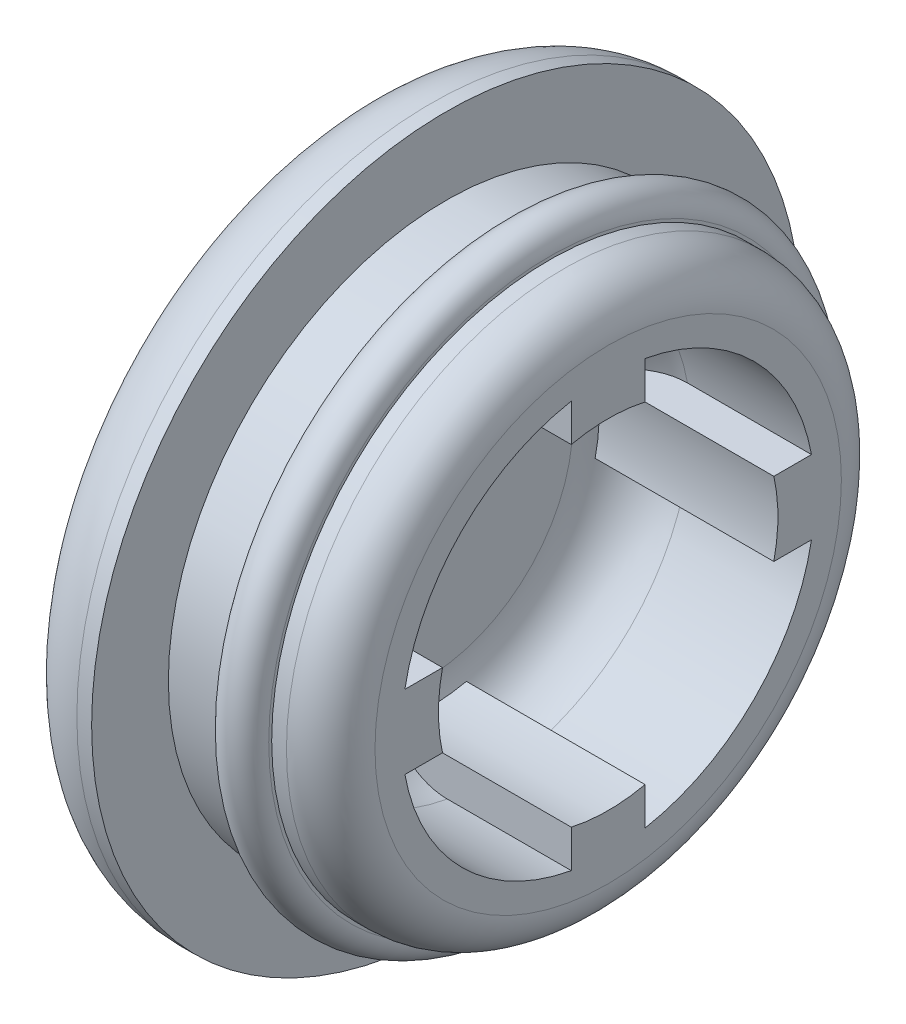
ISO-10303-21;
HEADER;
FILE_DESCRIPTION(('STEP AP214'),'2;1');
FILE_NAME('part.step','',(''),(''),'','','');
FILE_SCHEMA(('AUTOMOTIVE_DESIGN { 1 0 10303 214 1 1 1 1 }'));
ENDSEC;
DATA;
#1=APPLICATION_CONTEXT('core data for automotive mechanical design processes');
#2=APPLICATION_PROTOCOL_DEFINITION('international standard','automotive_design',2000,#1);
#3=PRODUCT_CONTEXT('',#1,'mechanical');
#4=PRODUCT('Part','Part','',(#3));
#5=PRODUCT_RELATED_PRODUCT_CATEGORY('part','',(#4));
#6=PRODUCT_DEFINITION_FORMATION('','',#4);
#7=PRODUCT_DEFINITION_CONTEXT('part definition',#1,'design');
#8=PRODUCT_DEFINITION('design','',#6,#7);
#9=PRODUCT_DEFINITION_SHAPE('','',#8);
#10=(LENGTH_UNIT() NAMED_UNIT(*) SI_UNIT(.MILLI.,.METRE.));
#11=(NAMED_UNIT(*) PLANE_ANGLE_UNIT() SI_UNIT($,.RADIAN.));
#12=(NAMED_UNIT(*) SI_UNIT($,.STERADIAN.) SOLID_ANGLE_UNIT());
#13=UNCERTAINTY_MEASURE_WITH_UNIT(LENGTH_MEASURE(1.E-05),#10,'distance_accuracy_value','');
#14=(GEOMETRIC_REPRESENTATION_CONTEXT(3) GLOBAL_UNCERTAINTY_ASSIGNED_CONTEXT((#13)) GLOBAL_UNIT_ASSIGNED_CONTEXT((#10,
#11,#12)) REPRESENTATION_CONTEXT('',''));
#15=CARTESIAN_POINT('',(0.,0.,0.));
#16=DIRECTION('',(0.,0.,1.));
#17=DIRECTION('',(1.,0.,0.));
#18=AXIS2_PLACEMENT_3D('',#15,#16,#17);
#19=CARTESIAN_POINT('',(0.,0.,0.));
#20=DIRECTION('',(-1.,0.,0.));
#21=DIRECTION('',(0.,0.,1.));
#22=AXIS2_PLACEMENT_3D('',#19,#20,#21);
#23=CYLINDRICAL_SURFACE('',#22,7.);
#24=CARTESIAN_POINT('',(4.30000000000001,0.,0.));
#25=DIRECTION('',(-1.,0.,0.));
#26=DIRECTION('',(0.,0.,1.));
#27=AXIS2_PLACEMENT_3D('',#24,#25,#26);
#28=CIRCLE('',#27,7.);
#29=CARTESIAN_POINT('',(4.30000000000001,6.88748865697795,-1.25));
#30=VERTEX_POINT('',#29);
#31=CARTESIAN_POINT('',(4.30000000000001,1.25,-6.88748865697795));
#32=VERTEX_POINT('',#31);
#33=EDGE_CURVE('E165',#30,#32,#28,.T.);
#34=ORIENTED_EDGE('',*,*,#33,.T.);
#35=DIRECTION('',(1.,0.,0.));
#36=VECTOR('',#35,1.);
#37=CARTESIAN_POINT('',(-0.000999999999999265,1.25,-6.88748865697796));
#38=LINE('',#37,#36);
#39=CARTESIAN_POINT('',(8.5,1.25,-6.88748865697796));
#40=VERTEX_POINT('',#39);
#41=EDGE_CURVE('E150',#32,#40,#38,.T.);
#42=ORIENTED_EDGE('',*,*,#41,.T.);
#43=CARTESIAN_POINT('',(8.5,0.,0.));
#44=DIRECTION('',(-1.,0.,0.));
#45=DIRECTION('',(0.,0.,1.));
#46=AXIS2_PLACEMENT_3D('',#43,#44,#45);
#47=CIRCLE('',#46,7.);
#48=CARTESIAN_POINT('',(8.5,6.88748865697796,-1.25));
#49=VERTEX_POINT('',#48);
#50=EDGE_CURVE('E163',#49,#40,#47,.T.);
#51=ORIENTED_EDGE('',*,*,#50,.F.);
#52=DIRECTION('',(1.,0.,0.));
#53=VECTOR('',#52,1.);
#54=CARTESIAN_POINT('',(-0.000999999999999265,6.88748865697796,-1.25));
#55=LINE('',#54,#53);
#56=EDGE_CURVE('E288',#30,#49,#55,.T.);
#57=ORIENTED_EDGE('',*,*,#56,.F.);
#58=EDGE_LOOP('',(#34,#42,#51,#57));
#59=FACE_BOUND('',#58,.T.);
#60=ADVANCED_FACE('F34',(#59),#23,.F.);
#61=CARTESIAN_POINT('',(8.5,-1.25,-6.88748865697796));
#62=VERTEX_POINT('',#61);
#63=CARTESIAN_POINT('',(8.5,-6.88748865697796,-1.25));
#64=VERTEX_POINT('',#63);
#65=EDGE_CURVE('E175',#62,#64,#47,.T.);
#66=ORIENTED_EDGE('',*,*,#65,.F.);
#67=DIRECTION('',(1.,0.,0.));
#68=VECTOR('',#67,1.);
#69=CARTESIAN_POINT('',(-0.000999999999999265,-1.25,-6.88748865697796));
#70=LINE('',#69,#68);
#71=CARTESIAN_POINT('',(4.30000000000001,-1.25,-6.88748865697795));
#72=VERTEX_POINT('',#71);
#73=EDGE_CURVE('E318',#72,#62,#70,.T.);
#74=ORIENTED_EDGE('',*,*,#73,.F.);
#75=CARTESIAN_POINT('',(4.30000000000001,-6.88748865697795,-1.25));
#76=VERTEX_POINT('',#75);
#77=EDGE_CURVE('E187',#72,#76,#28,.T.);
#78=ORIENTED_EDGE('',*,*,#77,.T.);
#79=DIRECTION('',(1.,0.,0.));
#80=VECTOR('',#79,1.);
#81=CARTESIAN_POINT('',(-0.000999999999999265,-6.88748865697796,-1.25));
#82=LINE('',#81,#80);
#83=EDGE_CURVE('E365',#76,#64,#82,.T.);
#84=ORIENTED_EDGE('',*,*,#83,.T.);
#85=EDGE_LOOP('',(#66,#74,#78,#84));
#86=FACE_BOUND('',#85,.T.);
#87=ADVANCED_FACE('F353',(#86),#23,.F.);
#88=CARTESIAN_POINT('',(4.30000000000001,1.25,6.88748865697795));
#89=VERTEX_POINT('',#88);
#90=CARTESIAN_POINT('',(4.30000000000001,6.88748865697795,1.25));
#91=VERTEX_POINT('',#90);
#92=EDGE_CURVE('E181',#89,#91,#28,.T.);
#93=ORIENTED_EDGE('',*,*,#92,.T.);
#94=DIRECTION('',(1.,0.,0.));
#95=VECTOR('',#94,1.);
#96=CARTESIAN_POINT('',(-0.000999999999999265,6.88748865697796,1.25));
#97=LINE('',#96,#95);
#98=CARTESIAN_POINT('',(8.5,6.88748865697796,1.25));
#99=VERTEX_POINT('',#98);
#100=EDGE_CURVE('E271',#91,#99,#97,.T.);
#101=ORIENTED_EDGE('',*,*,#100,.T.);
#102=CARTESIAN_POINT('',(8.5,1.25,6.88748865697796));
#103=VERTEX_POINT('',#102);
#104=EDGE_CURVE('E174',#103,#99,#47,.T.);
#105=ORIENTED_EDGE('',*,*,#104,.F.);
#106=DIRECTION('',(1.,0.,0.));
#107=VECTOR('',#106,1.);
#108=CARTESIAN_POINT('',(-0.000999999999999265,1.25,6.88748865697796));
#109=LINE('',#108,#107);
#110=EDGE_CURVE('E220',#89,#103,#109,.T.);
#111=ORIENTED_EDGE('',*,*,#110,.F.);
#112=EDGE_LOOP('',(#93,#101,#105,#111));
#113=FACE_BOUND('',#112,.T.);
#114=ADVANCED_FACE('F270',(#113),#23,.F.);
#115=CARTESIAN_POINT('',(0.,0.,0.));
#116=DIRECTION('',(1.,0.,0.));
#117=DIRECTION('',(0.,0.,-1.));
#118=AXIS2_PLACEMENT_3D('',#115,#116,#117);
#119=PLANE('',#118);
#120=CARTESIAN_POINT('',(0.,0.,0.));
#121=DIRECTION('',(-1.,0.,0.));
#122=DIRECTION('',(0.,0.,1.));
#123=AXIS2_PLACEMENT_3D('',#120,#121,#122);
#124=CIRCLE('',#123,9.49999999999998);
#125=CARTESIAN_POINT('',(0.,0.,9.49999999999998));
#126=VERTEX_POINT('',#125);
#127=EDGE_CURVE('E11',#126,#126,#124,.T.);
#128=ORIENTED_EDGE('',*,*,#127,.T.);
#129=EDGE_LOOP('',(#128));
#130=FACE_BOUND('',#129,.T.);
#131=ADVANCED_FACE('F36',(#130),#119,.F.);
#132=CARTESIAN_POINT('',(2.5,0.,0.));
#133=DIRECTION('',(-1.,0.,0.));
#134=DIRECTION('',(0.,0.,1.));
#135=AXIS2_PLACEMENT_3D('',#132,#133,#134);
#136=TOROIDAL_SURFACE('',#135,9.5,2.5);
#137=ORIENTED_EDGE('',*,*,#127,.F.);
#138=EDGE_LOOP('',(#137));
#139=FACE_BOUND('',#138,.T.);
#140=CARTESIAN_POINT('',(2.50000000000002,0.,0.));
#141=DIRECTION('',(-1.,0.,0.));
#142=DIRECTION('',(0.,0.,1.));
#143=AXIS2_PLACEMENT_3D('',#140,#141,#142);
#144=CIRCLE('',#143,12.);
#145=CARTESIAN_POINT('',(2.50000000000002,0.,12.));
#146=VERTEX_POINT('',#145);
#147=EDGE_CURVE('E42',#146,#146,#144,.T.);
#148=ORIENTED_EDGE('',*,*,#147,.T.);
#149=EDGE_LOOP('',(#148));
#150=FACE_BOUND('',#149,.T.);
#151=ADVANCED_FACE('F413',(#139,#150),#136,.T.);
#152=CARTESIAN_POINT('',(0.,0.,0.));
#153=DIRECTION('',(-1.,0.,0.));
#154=DIRECTION('',(0.,0.,1.));
#155=AXIS2_PLACEMENT_3D('',#152,#153,#154);
#156=CYLINDRICAL_SURFACE('',#155,12.);
#157=ORIENTED_EDGE('',*,*,#147,.F.);
#158=EDGE_LOOP('',(#157));
#159=FACE_BOUND('',#158,.T.);
#160=CARTESIAN_POINT('',(3.,0.,0.));
#161=DIRECTION('',(-1.,0.,0.));
#162=DIRECTION('',(0.,0.,1.));
#163=AXIS2_PLACEMENT_3D('',#160,#161,#162);
#164=CIRCLE('',#163,12.);
#165=CARTESIAN_POINT('',(3.,0.,12.));
#166=VERTEX_POINT('',#165);
#167=EDGE_CURVE('E425',#166,#166,#164,.T.);
#168=ORIENTED_EDGE('',*,*,#167,.T.);
#169=EDGE_LOOP('',(#168));
#170=FACE_BOUND('',#169,.T.);
#171=ADVANCED_FACE('F418',(#159,#170),#156,.T.);
#172=CARTESIAN_POINT('',(3.,12.,0.));
#173=DIRECTION('',(-1.,0.,0.));
#174=DIRECTION('',(0.,0.,1.));
#175=AXIS2_PLACEMENT_3D('',#172,#173,#174);
#176=PLANE('',#175);
#177=ORIENTED_EDGE('',*,*,#167,.F.);
#178=EDGE_LOOP('',(#177));
#179=FACE_BOUND('',#178,.T.);
#180=CARTESIAN_POINT('',(3.,0.,0.));
#181=DIRECTION('',(-1.,0.,0.));
#182=DIRECTION('',(0.,0.,1.));
#183=AXIS2_PLACEMENT_3D('',#180,#181,#182);
#184=CIRCLE('',#183,9.4);
#185=CARTESIAN_POINT('',(3.,0.,9.4));
#186=VERTEX_POINT('',#185);
#187=EDGE_CURVE('E427',#186,#186,#184,.T.);
#188=ORIENTED_EDGE('',*,*,#187,.T.);
#189=EDGE_LOOP('',(#188));
#190=FACE_BOUND('',#189,.T.);
#191=ADVANCED_FACE('F475',(#179,#190),#176,.F.);
#192=CARTESIAN_POINT('',(0.,0.,0.));
#193=DIRECTION('',(-1.,0.,0.));
#194=DIRECTION('',(0.,0.,1.));
#195=AXIS2_PLACEMENT_3D('',#192,#193,#194);
#196=CYLINDRICAL_SURFACE('',#195,9.4);
#197=ORIENTED_EDGE('',*,*,#187,.F.);
#198=EDGE_LOOP('',(#197));
#199=FACE_BOUND('',#198,.T.);
#200=CARTESIAN_POINT('',(5.,0.,0.));
#201=DIRECTION('',(-1.,0.,0.));
#202=DIRECTION('',(0.,0.,1.));
#203=AXIS2_PLACEMENT_3D('',#200,#201,#202);
#204=CIRCLE('',#203,9.4);
#205=CARTESIAN_POINT('',(5.,0.,9.4));
#206=VERTEX_POINT('',#205);
#207=EDGE_CURVE('E432',#206,#206,#204,.T.);
#208=ORIENTED_EDGE('',*,*,#207,.T.);
#209=EDGE_LOOP('',(#208));
#210=FACE_BOUND('',#209,.T.);
#211=ADVANCED_FACE('F471',(#199,#210),#196,.T.);
#212=CARTESIAN_POINT('',(5.,9.4,0.));
#213=DIRECTION('',(1.,0.,0.));
#214=DIRECTION('',(0.,0.,-1.));
#215=AXIS2_PLACEMENT_3D('',#212,#213,#214);
#216=PLANE('',#215);
#217=ORIENTED_EDGE('',*,*,#207,.F.);
#218=EDGE_LOOP('',(#217));
#219=FACE_BOUND('',#218,.T.);
#220=CARTESIAN_POINT('',(5.,0.,0.));
#221=DIRECTION('',(-1.,0.,0.));
#222=DIRECTION('',(0.,0.,1.));
#223=AXIS2_PLACEMENT_3D('',#220,#221,#222);
#224=CIRCLE('',#223,9.5);
#225=CARTESIAN_POINT('',(5.,0.,9.5));
#226=VERTEX_POINT('',#225);
#227=EDGE_CURVE('E435',#226,#226,#224,.T.);
#228=ORIENTED_EDGE('',*,*,#227,.T.);
#229=EDGE_LOOP('',(#228));
#230=FACE_BOUND('',#229,.T.);
#231=ADVANCED_FACE('F467',(#219,#230),#216,.F.);
#232=CARTESIAN_POINT('',(5.75,0.,0.));
#233=DIRECTION('',(-1.,0.,0.));
#234=DIRECTION('',(0.,0.,1.));
#235=AXIS2_PLACEMENT_3D('',#232,#233,#234);
#236=TOROIDAL_SURFACE('',#235,9.5,0.75);
#237=ORIENTED_EDGE('',*,*,#227,.F.);
#238=EDGE_LOOP('',(#237));
#239=FACE_BOUND('',#238,.T.);
#240=CARTESIAN_POINT('',(6.5,0.,0.));
#241=DIRECTION('',(-1.,0.,0.));
#242=DIRECTION('',(0.,0.,1.));
#243=AXIS2_PLACEMENT_3D('',#240,#241,#242);
#244=CIRCLE('',#243,9.5);
#245=CARTESIAN_POINT('',(6.5,0.,9.5));
#246=VERTEX_POINT('',#245);
#247=EDGE_CURVE('E438',#246,#246,#244,.T.);
#248=ORIENTED_EDGE('',*,*,#247,.T.);
#249=EDGE_LOOP('',(#248));
#250=FACE_BOUND('',#249,.T.);
#251=ADVANCED_FACE('F463',(#239,#250),#236,.T.);
#252=CARTESIAN_POINT('',(6.5,9.5,0.));
#253=DIRECTION('',(-1.,0.,0.));
#254=DIRECTION('',(0.,0.,1.));
#255=AXIS2_PLACEMENT_3D('',#252,#253,#254);
#256=PLANE('',#255);
#257=ORIENTED_EDGE('',*,*,#247,.F.);
#258=EDGE_LOOP('',(#257));
#259=FACE_BOUND('',#258,.T.);
#260=CARTESIAN_POINT('',(6.5,0.,0.));
#261=DIRECTION('',(-1.,0.,0.));
#262=DIRECTION('',(0.,0.,1.));
#263=AXIS2_PLACEMENT_3D('',#260,#261,#262);
#264=CIRCLE('',#263,9.4);
#265=CARTESIAN_POINT('',(6.5,0.,9.4));
#266=VERTEX_POINT('',#265);
#267=EDGE_CURVE('E441',#266,#266,#264,.T.);
#268=ORIENTED_EDGE('',*,*,#267,.T.);
#269=EDGE_LOOP('',(#268));
#270=FACE_BOUND('',#269,.T.);
#271=ADVANCED_FACE('F456',(#259,#270),#256,.F.);
#272=CARTESIAN_POINT('',(0.,0.,0.));
#273=DIRECTION('',(-1.,0.,0.));
#274=DIRECTION('',(0.,0.,1.));
#275=AXIS2_PLACEMENT_3D('',#272,#273,#274);
#276=CYLINDRICAL_SURFACE('',#275,9.4);
#277=ORIENTED_EDGE('',*,*,#267,.F.);
#278=EDGE_LOOP('',(#277));
#279=FACE_BOUND('',#278,.T.);
#280=CARTESIAN_POINT('',(6.99999999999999,0.,0.));
#281=DIRECTION('',(-1.,0.,0.));
#282=DIRECTION('',(0.,0.,1.));
#283=AXIS2_PLACEMENT_3D('',#280,#281,#282);
#284=CIRCLE('',#283,9.4);
#285=CARTESIAN_POINT('',(6.99999999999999,0.,9.4));
#286=VERTEX_POINT('',#285);
#287=EDGE_CURVE('E444',#286,#286,#284,.T.);
#288=ORIENTED_EDGE('',*,*,#287,.T.);
#289=EDGE_LOOP('',(#288));
#290=FACE_BOUND('',#289,.T.);
#291=ADVANCED_FACE('F450',(#279,#290),#276,.T.);
#292=CARTESIAN_POINT('',(7.,0.,0.));
#293=DIRECTION('',(-1.,0.,0.));
#294=DIRECTION('',(0.,0.,1.));
#295=AXIS2_PLACEMENT_3D('',#292,#293,#294);
#296=TOROIDAL_SURFACE('',#295,7.9,1.5);
#297=ORIENTED_EDGE('',*,*,#287,.F.);
#298=EDGE_LOOP('',(#297));
#299=FACE_BOUND('',#298,.T.);
#300=CARTESIAN_POINT('',(8.5,0.,0.));
#301=DIRECTION('',(-1.,0.,0.));
#302=DIRECTION('',(0.,0.,1.));
#303=AXIS2_PLACEMENT_3D('',#300,#301,#302);
#304=CIRCLE('',#303,7.89999999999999);
#305=CARTESIAN_POINT('',(8.5,0.,7.89999999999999));
#306=VERTEX_POINT('',#305);
#307=EDGE_CURVE('E178',#306,#306,#304,.T.);
#308=ORIENTED_EDGE('',*,*,#307,.T.);
#309=EDGE_LOOP('',(#308));
#310=FACE_BOUND('',#309,.T.);
#311=ADVANCED_FACE('F407',(#299,#310),#296,.T.);
#312=CARTESIAN_POINT('',(8.5,7.89999999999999,0.));
#313=DIRECTION('',(-1.,0.,0.));
#314=DIRECTION('',(0.,0.,1.));
#315=AXIS2_PLACEMENT_3D('',#312,#313,#314);
#316=PLANE('',#315);
#317=ORIENTED_EDGE('',*,*,#307,.F.);
#318=EDGE_LOOP('',(#317));
#319=FACE_BOUND('',#318,.T.);
#320=ORIENTED_EDGE('',*,*,#104,.T.);
#321=DIRECTION('',(0.,-1.,0.));
#322=VECTOR('',#321,1.);
#323=CARTESIAN_POINT('',(8.5,6.88748865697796,1.25));
#324=LINE('',#323,#322);
#325=CARTESIAN_POINT('',(8.5,5.61248608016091,1.25));
#326=VERTEX_POINT('',#325);
#327=EDGE_CURVE('E305',#99,#326,#324,.T.);
#328=ORIENTED_EDGE('',*,*,#327,.T.);
#329=CARTESIAN_POINT('',(8.5,0.,0.));
#330=DIRECTION('',(-1.,0.,0.));
#331=DIRECTION('',(0.,0.,-1.));
#332=AXIS2_PLACEMENT_3D('',#329,#330,#331);
#333=CIRCLE('',#332,5.75);
#334=CARTESIAN_POINT('',(8.5,5.61248608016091,-1.25));
#335=VERTEX_POINT('',#334);
#336=EDGE_CURVE('E279',#326,#335,#333,.T.);
#337=ORIENTED_EDGE('',*,*,#336,.T.);
#338=DIRECTION('',(0.,1.,0.));
#339=VECTOR('',#338,1.);
#340=CARTESIAN_POINT('',(8.5,6.88748865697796,-1.25));
#341=LINE('',#340,#339);
#342=EDGE_CURVE('E173',#335,#49,#341,.T.);
#343=ORIENTED_EDGE('',*,*,#342,.T.);
#344=ORIENTED_EDGE('',*,*,#50,.T.);
#345=DIRECTION('',(0.,0.,1.));
#346=VECTOR('',#345,1.);
#347=CARTESIAN_POINT('',(8.5,1.25,-5.61248608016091));
#348=LINE('',#347,#346);
#349=CARTESIAN_POINT('',(8.5,1.25,-5.61248608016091));
#350=VERTEX_POINT('',#349);
#351=EDGE_CURVE('E146',#40,#350,#348,.T.);
#352=ORIENTED_EDGE('',*,*,#351,.T.);
#353=CARTESIAN_POINT('',(8.5,0.,0.));
#354=DIRECTION('',(-1.,0.,0.));
#355=DIRECTION('',(0.,0.,-1.));
#356=AXIS2_PLACEMENT_3D('',#353,#354,#355);
#357=CIRCLE('',#356,5.75);
#358=CARTESIAN_POINT('',(8.5,-1.25,-5.61248608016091));
#359=VERTEX_POINT('',#358);
#360=EDGE_CURVE('E157',#350,#359,#357,.T.);
#361=ORIENTED_EDGE('',*,*,#360,.T.);
#362=DIRECTION('',(0.,0.,-1.));
#363=VECTOR('',#362,1.);
#364=CARTESIAN_POINT('',(8.5,-1.25,-5.61248608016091));
#365=LINE('',#364,#363);
#366=EDGE_CURVE('E166',#359,#62,#365,.T.);
#367=ORIENTED_EDGE('',*,*,#366,.T.);
#368=ORIENTED_EDGE('',*,*,#65,.T.);
#369=DIRECTION('',(0.,1.,0.));
#370=VECTOR('',#369,1.);
#371=CARTESIAN_POINT('',(8.5,-5.61248608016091,-1.25));
#372=LINE('',#371,#370);
#373=CARTESIAN_POINT('',(8.5,-5.61248608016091,-1.25));
#374=VERTEX_POINT('',#373);
#375=EDGE_CURVE('E344',#64,#374,#372,.T.);
#376=ORIENTED_EDGE('',*,*,#375,.T.);
#377=CARTESIAN_POINT('',(8.5,0.,0.));
#378=DIRECTION('',(-1.,0.,0.));
#379=DIRECTION('',(0.,0.,-1.));
#380=AXIS2_PLACEMENT_3D('',#377,#378,#379);
#381=CIRCLE('',#380,5.75);
#382=CARTESIAN_POINT('',(8.5,-5.61248608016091,1.25));
#383=VERTEX_POINT('',#382);
#384=EDGE_CURVE('E378',#374,#383,#381,.T.);
#385=ORIENTED_EDGE('',*,*,#384,.T.);
#386=DIRECTION('',(0.,-1.,0.));
#387=VECTOR('',#386,1.);
#388=CARTESIAN_POINT('',(8.5,-5.61248608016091,1.25));
#389=LINE('',#388,#387);
#390=CARTESIAN_POINT('',(8.5,-6.88748865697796,1.25));
#391=VERTEX_POINT('',#390);
#392=EDGE_CURVE('E381',#383,#391,#389,.T.);
#393=ORIENTED_EDGE('',*,*,#392,.T.);
#394=CARTESIAN_POINT('',(8.5,-1.25,6.88748865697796));
#395=VERTEX_POINT('',#394);
#396=EDGE_CURVE('E177',#391,#395,#47,.T.);
#397=ORIENTED_EDGE('',*,*,#396,.T.);
#398=DIRECTION('',(0.,0.,-1.));
#399=VECTOR('',#398,1.);
#400=CARTESIAN_POINT('',(8.5,-1.25,6.88748865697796));
#401=LINE('',#400,#399);
#402=CARTESIAN_POINT('',(8.5,-1.25,5.61248608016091));
#403=VERTEX_POINT('',#402);
#404=EDGE_CURVE('E242',#395,#403,#401,.T.);
#405=ORIENTED_EDGE('',*,*,#404,.T.);
#406=CARTESIAN_POINT('',(8.5,0.,0.));
#407=DIRECTION('',(-1.,0.,0.));
#408=DIRECTION('',(0.,0.,-1.));
#409=AXIS2_PLACEMENT_3D('',#406,#407,#408);
#410=CIRCLE('',#409,5.75);
#411=CARTESIAN_POINT('',(8.5,1.25,5.61248608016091));
#412=VERTEX_POINT('',#411);
#413=EDGE_CURVE('E244',#403,#412,#410,.T.);
#414=ORIENTED_EDGE('',*,*,#413,.T.);
#415=DIRECTION('',(0.,0.,1.));
#416=VECTOR('',#415,1.);
#417=CARTESIAN_POINT('',(8.5,1.25,6.88748865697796));
#418=LINE('',#417,#416);
#419=EDGE_CURVE('E248',#412,#103,#418,.T.);
#420=ORIENTED_EDGE('',*,*,#419,.T.);
#421=EDGE_LOOP('',(#320,#328,#337,#343,#344,#352,#361,#367,#368,#376,#385,#393,#397,#405,#414,#420));
#422=FACE_BOUND('',#421,.T.);
#423=ADVANCED_FACE('F170',(#319,#422),#316,.F.);
#424=ORIENTED_EDGE('',*,*,#396,.F.);
#425=DIRECTION('',(1.,0.,0.));
#426=VECTOR('',#425,1.);
#427=CARTESIAN_POINT('',(-0.000999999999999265,-6.88748865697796,1.25));
#428=LINE('',#427,#426);
#429=CARTESIAN_POINT('',(4.30000000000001,-6.88748865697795,1.25));
#430=VERTEX_POINT('',#429);
#431=EDGE_CURVE('E358',#430,#391,#428,.T.);
#432=ORIENTED_EDGE('',*,*,#431,.F.);
#433=CARTESIAN_POINT('',(4.30000000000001,-1.25,6.88748865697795));
#434=VERTEX_POINT('',#433);
#435=EDGE_CURVE('E192',#430,#434,#28,.T.);
#436=ORIENTED_EDGE('',*,*,#435,.T.);
#437=DIRECTION('',(1.,0.,0.));
#438=VECTOR('',#437,1.);
#439=CARTESIAN_POINT('',(-0.000999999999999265,-1.25,6.88748865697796));
#440=LINE('',#439,#438);
#441=EDGE_CURVE('E221',#434,#395,#440,.T.);
#442=ORIENTED_EDGE('',*,*,#441,.T.);
#443=EDGE_LOOP('',(#424,#432,#436,#442));
#444=FACE_BOUND('',#443,.T.);
#445=ADVANCED_FACE('F256',(#444),#23,.F.);
#446=CARTESIAN_POINT('',(4.3,0.,0.));
#447=DIRECTION('',(-1.,0.,0.));
#448=DIRECTION('',(0.,0.,1.));
#449=AXIS2_PLACEMENT_3D('',#446,#447,#448);
#450=TOROIDAL_SURFACE('',#449,5.,2.);
#451=CARTESIAN_POINT('',(2.44595037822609,0.,0.));
#452=DIRECTION('',(1.,0.,0.));
#453=DIRECTION('',(0.,0.,-1.));
#454=AXIS2_PLACEMENT_3D('',#451,#452,#453);
#455=CIRCLE('',#454,5.75);
#456=CARTESIAN_POINT('',(2.44595037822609,1.25,-5.61248608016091));
#457=VERTEX_POINT('',#456);
#458=CARTESIAN_POINT('',(2.44595037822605,-1.25,-5.61248608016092));
#459=VERTEX_POINT('',#458);
#460=EDGE_CURVE('E49',#457,#459,#455,.F.);
#461=ORIENTED_EDGE('',*,*,#460,.F.);
#462=CARTESIAN_POINT('',(3.11051441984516,1.25,-6.48852410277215));
#463=CARTESIAN_POINT('',(3.01965798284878,1.25,-6.42006474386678));
#464=CARTESIAN_POINT('',(2.93459205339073,1.25,-6.34376158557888));
#465=CARTESIAN_POINT('',(2.77849510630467,1.25,-6.17781417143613));
#466=CARTESIAN_POINT('',(2.70748444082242,1.25,-6.08815089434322));
#467=CARTESIAN_POINT('',(2.58154382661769,1.25,-5.89834430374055));
#468=CARTESIAN_POINT('',(2.52659160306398,1.25,-5.79821577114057));
#469=CARTESIAN_POINT('',(2.4339829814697,1.25,-5.59030711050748));
#470=CARTESIAN_POINT('',(2.39632215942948,1.25,-5.4825289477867));
#471=CARTESIAN_POINT('',(2.33856477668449,1.25,-5.26041981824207));
#472=CARTESIAN_POINT('',(2.31877646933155,1.25,-5.1460087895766));
#473=CARTESIAN_POINT('',(2.29813562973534,1.25,-4.91549076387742));
#474=CARTESIAN_POINT('',(2.29728646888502,1.25,-4.79938346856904));
#475=CARTESIAN_POINT('',(2.3145327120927,1.25,-4.56537787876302));
#476=CARTESIAN_POINT('',(2.33314907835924,1.25,-4.4475179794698));
#477=CARTESIAN_POINT('',(2.38941009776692,1.25,-4.21642815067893));
#478=CARTESIAN_POINT('',(2.4270577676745,1.25,-4.10319895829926));
#479=CARTESIAN_POINT('',(2.52142158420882,1.25,-3.88167083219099));
#480=CARTESIAN_POINT('',(2.57858418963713,1.25,-3.77356180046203));
#481=CARTESIAN_POINT('',(2.71020205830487,1.25,-3.56840007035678));
#482=CARTESIAN_POINT('',(2.78466058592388,1.25,-3.47134946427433));
#483=CARTESIAN_POINT('',(2.94920068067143,1.25,-3.29113020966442));
#484=CARTESIAN_POINT('',(3.03931415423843,1.25,-3.20799060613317));
#485=CARTESIAN_POINT('',(3.23282513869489,1.25,-3.05890399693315));
#486=CARTESIAN_POINT('',(3.33621908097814,1.25,-2.99295238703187));
#487=CARTESIAN_POINT('',(3.54820177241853,1.25,-2.88398330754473));
#488=CARTESIAN_POINT('',(3.65629809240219,1.25,-2.84001163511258));
#489=CARTESIAN_POINT('',(3.87872920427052,1.25,-2.77277391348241));
#490=CARTESIAN_POINT('',(3.99305882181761,1.25,-2.74949095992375));
#491=CARTESIAN_POINT('',(4.21424851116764,1.25,-2.72610048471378));
#492=CARTESIAN_POINT('',(4.32092106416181,1.25,-2.72419707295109));
#493=CARTESIAN_POINT('',(4.53295015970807,1.25,-2.73902894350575));
#494=CARTESIAN_POINT('',(4.63830687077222,1.25,-2.75576181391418));
#495=CARTESIAN_POINT('',(4.8411061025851,1.25,-2.80607042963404));
#496=CARTESIAN_POINT('',(4.93869563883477,1.25,-2.83906044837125));
#497=CARTESIAN_POINT('',(5.12739538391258,1.25,-2.92009314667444));
#498=CARTESIAN_POINT('',(5.21850410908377,1.25,-2.96813925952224));
#499=CARTESIAN_POINT('',(5.39720195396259,1.25,-3.08059183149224));
#500=CARTESIAN_POINT('',(5.48430850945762,1.25,-3.14576359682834));
#501=CARTESIAN_POINT('',(5.64739302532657,1.25,-3.2887887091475));
#502=CARTESIAN_POINT('',(5.72336720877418,1.25,-3.36664634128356));
#503=CARTESIAN_POINT('',(5.86830678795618,1.25,-3.53961555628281));
#504=CARTESIAN_POINT('',(5.93621985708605,1.25,-3.6356105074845));
#505=CARTESIAN_POINT('',(6.05575105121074,1.25,-3.83726740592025));
#506=CARTESIAN_POINT('',(6.10736519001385,1.25,-3.9429317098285));
#507=CARTESIAN_POINT('',(6.19478442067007,1.25,-4.16579636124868));
#508=CARTESIAN_POINT('',(6.22983134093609,1.25,-4.2832952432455));
#509=CARTESIAN_POINT('',(6.27964249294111,1.25,-4.52252602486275));
#510=CARTESIAN_POINT('',(6.29440630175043,1.25,-4.64425801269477));
#511=CARTESIAN_POINT('',(6.30295477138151,1.25,-4.88808796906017));
#512=CARTESIAN_POINT('',(6.29680539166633,1.25,-5.01018357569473));
#513=CARTESIAN_POINT('',(6.26354313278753,1.25,-5.25149276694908));
#514=CARTESIAN_POINT('',(6.23643281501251,1.25,-5.37070670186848));
#515=CARTESIAN_POINT('',(6.16271871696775,1.25,-5.59962100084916));
#516=CARTESIAN_POINT('',(6.11662591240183,1.25,-5.7094858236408));
#517=CARTESIAN_POINT('',(6.00613594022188,1.25,-5.91959520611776));
#518=CARTESIAN_POINT('',(5.9417415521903,1.25,-6.01984122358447));
#519=CARTESIAN_POINT('',(5.79842829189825,1.25,-6.20491816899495));
#520=CARTESIAN_POINT('',(5.71996193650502,1.25,-6.2900996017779));
#521=CARTESIAN_POINT('',(5.54955962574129,1.25,-6.44571662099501));
#522=CARTESIAN_POINT('',(5.4576253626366,1.25,-6.51615405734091));
#523=CARTESIAN_POINT('',(5.26506968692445,1.25,-6.63870372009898));
#524=CARTESIAN_POINT('',(5.16468032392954,1.25,-6.6911807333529));
#525=CARTESIAN_POINT('',(4.95643379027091,1.25,-6.778265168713));
#526=CARTESIAN_POINT('',(4.84857757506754,1.25,-6.81287487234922));
#527=CARTESIAN_POINT('',(4.63005690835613,1.25,-6.86280257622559));
#528=CARTESIAN_POINT('',(4.51945158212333,1.25,-6.87837967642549));
#529=CARTESIAN_POINT('',(4.29716791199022,1.25,-6.89063190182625));
#530=CARTESIAN_POINT('',(4.18548933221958,1.25,-6.88730277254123));
#531=CARTESIAN_POINT('',(3.96486865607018,1.25,-6.86190706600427));
#532=CARTESIAN_POINT('',(3.85591562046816,1.25,-6.83993482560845));
#533=CARTESIAN_POINT('',(3.64333590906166,1.25,-6.77805356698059));
#534=CARTESIAN_POINT('',(3.53970251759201,1.25,-6.73816781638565));
#535=CARTESIAN_POINT('',(3.38213090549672,1.25,-6.66185097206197));
#536=CARTESIAN_POINT('',(3.32547222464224,1.25,-6.63090013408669));
#537=CARTESIAN_POINT('',(3.2154264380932,1.25,-6.56364839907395));
#538=CARTESIAN_POINT('',(3.16203930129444,1.25,-6.52734755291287));
#539=CARTESIAN_POINT('',(3.11051441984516,1.25,-6.48852410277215));
#540=B_SPLINE_CURVE_WITH_KNOTS('',3,(#462,#463,#464,#465,#466,#467,#468,#469,#470,#471,#472,
#473,#474,#475,#476,#477,#478,#479,#480,#481,#482,#483,#484,#485,#486,#487,#488,#489,#490,#491,
#492,#493,#494,#495,#496,#497,#498,#499,#500,#501,#502,#503,#504,#505,#506,#507,#508,#509,#510,
#511,#512,#513,#514,#515,#516,#517,#518,#519,#520,#521,#522,#523,#524,#525,#526,#527,#528,#529,
#530,#531,#532,#533,#534,#535,#536,#537,#538,#539),.UNSPECIFIED.,.T.,.F.,(4,2,2,2,2,2,2,2,2,2,2,
2,2,2,2,2,2,2,2,2,2,2,2,2,2,2,2,2,2,2,2,2,2,2,2,2,2,2,4),(0.,0.341041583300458,
0.682573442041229,1.02362928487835,1.36459781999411,1.71134068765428,2.05814527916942,
2.41447502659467,2.77086127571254,3.13601787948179,3.50124345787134,3.86722232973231,
4.23310306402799,4.58130420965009,4.9292205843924,5.24766907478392,5.56607635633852,
5.87376893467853,6.18153172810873,6.50652361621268,6.8316255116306,7.18282687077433,
7.53411405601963,7.9002101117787,8.26631380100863,8.63126388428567,8.99616937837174,
9.35183510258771,9.707446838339,10.0531928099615,10.3988953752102,10.737089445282,
11.0752403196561,11.4087345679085,11.7423038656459,12.0741952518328,12.405656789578,
12.5990640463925,12.7924694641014),.UNSPECIFIED.);
#541=EDGE_CURVE('E316',#32,#457,#540,.T.);
#542=ORIENTED_EDGE('',*,*,#541,.F.);
#543=ORIENTED_EDGE('',*,*,#33,.F.);
#544=CARTESIAN_POINT('',(2.59046576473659,5.90721823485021,-1.25));
#545=CARTESIAN_POINT('',(2.64816329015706,6.00433632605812,-1.25));
#546=CARTESIAN_POINT('',(2.71397519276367,6.09671753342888,-1.25));
#547=CARTESIAN_POINT('',(2.86016986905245,6.26924596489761,-1.25));
#548=CARTESIAN_POINT('',(2.9405666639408,6.3493812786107,-1.25));
#549=CARTESIAN_POINT('',(3.11376876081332,6.49496625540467,-1.25));
#550=CARTESIAN_POINT('',(3.20657755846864,6.56041176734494,-1.25));
#551=CARTESIAN_POINT('',(3.40195645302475,6.67455547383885,-1.25));
#552=CARTESIAN_POINT('',(3.50452431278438,6.72325749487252,-1.25));
#553=CARTESIAN_POINT('',(3.71522980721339,6.80195358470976,-1.25));
#554=CARTESIAN_POINT('',(3.82328798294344,6.83216042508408,-1.25));
#555=CARTESIAN_POINT('',(4.04296174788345,6.87382802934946,-1.25));
#556=CARTESIAN_POINT('',(4.15457723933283,6.88528930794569,-1.25));
#557=CARTESIAN_POINT('',(4.37716443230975,6.88909616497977,-1.25));
#558=CARTESIAN_POINT('',(4.48813335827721,6.88160613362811,-1.25));
#559=CARTESIAN_POINT('',(4.70723154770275,6.84808538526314,-1.25));
#560=CARTESIAN_POINT('',(4.81536086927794,6.82205504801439,-1.25));
#561=CARTESIAN_POINT('',(5.02564928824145,6.75226732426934,-1.25));
#562=CARTESIAN_POINT('',(5.12781255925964,6.70852250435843,-1.25));
#563=CARTESIAN_POINT('',(5.3234139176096,6.60461769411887,-1.25));
#564=CARTESIAN_POINT('',(5.41685185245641,6.54445741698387,-1.25));
#565=CARTESIAN_POINT('',(5.59309379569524,6.40901685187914,-1.25));
#566=CARTESIAN_POINT('',(5.67581763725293,6.33363229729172,-1.25));
#567=CARTESIAN_POINT('',(5.82765742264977,6.17022670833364,-1.25));
#568=CARTESIAN_POINT('',(5.89677259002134,6.0822049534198,-1.25));
#569=CARTESIAN_POINT('',(6.02057499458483,5.89465315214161,-1.25));
#570=CARTESIAN_POINT('',(6.07503212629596,5.79497128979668,-1.25));
#571=CARTESIAN_POINT('',(6.16684826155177,5.58802917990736,-1.25));
#572=CARTESIAN_POINT('',(6.2042056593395,5.48076822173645,-1.25));
#573=CARTESIAN_POINT('',(6.26168733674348,5.25917227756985,-1.25));
#574=CARTESIAN_POINT('',(6.2814088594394,5.14473289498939,-1.25));
#575=CARTESIAN_POINT('',(6.30191026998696,4.91417492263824,-1.25));
#576=CARTESIAN_POINT('',(6.30268759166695,4.79805610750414,-1.25));
#577=CARTESIAN_POINT('',(6.28529430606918,4.56404428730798,-1.25));
#578=CARTESIAN_POINT('',(6.2666035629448,4.44618993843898,-1.25));
#579=CARTESIAN_POINT('',(6.21019533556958,4.21512324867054,-1.25));
#580=CARTESIAN_POINT('',(6.17247480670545,4.10191165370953,-1.25));
#581=CARTESIAN_POINT('',(6.07796750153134,3.88043352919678,-1.25));
#582=CARTESIAN_POINT('',(6.02073471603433,3.77235704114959,-1.25));
#583=CARTESIAN_POINT('',(5.88898154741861,3.56727228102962,-1.25));
#584=CARTESIAN_POINT('',(5.81445786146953,3.47026612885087,-1.25));
#585=CARTESIAN_POINT('',(5.64979974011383,3.290154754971,-1.25));
#586=CARTESIAN_POINT('',(5.55963451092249,3.20707760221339,-1.25));
#587=CARTESIAN_POINT('',(5.36603059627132,3.05812651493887,-1.25));
#588=CARTESIAN_POINT('',(5.26259551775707,2.99224792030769,-1.25));
#589=CARTESIAN_POINT('',(5.05055695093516,2.88343676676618,-1.25));
#590=CARTESIAN_POINT('',(4.94244635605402,2.8395474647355,-1.25));
#591=CARTESIAN_POINT('',(4.72000205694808,2.77247577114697,-1.25));
#592=CARTESIAN_POINT('',(4.60567350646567,2.74927650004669,-1.25));
#593=CARTESIAN_POINT('',(4.3845009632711,2.7260427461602,-1.25));
#594=CARTESIAN_POINT('',(4.27784318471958,2.72421271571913,-1.25));
#595=CARTESIAN_POINT('',(4.06585574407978,2.73918405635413,-1.25));
#596=CARTESIAN_POINT('',(3.96052591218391,2.75598302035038,-1.25));
#597=CARTESIAN_POINT('',(3.75777071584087,2.80641593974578,-1.25));
#598=CARTESIAN_POINT('',(3.66019877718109,2.83946747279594,-1.25));
#599=CARTESIAN_POINT('',(3.47154260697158,2.92061778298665,-1.25));
#600=CARTESIAN_POINT('',(3.38045987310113,2.96872002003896,-1.25));
#601=CARTESIAN_POINT('',(3.20181188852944,3.08128846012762,-1.25));
#602=CARTESIAN_POINT('',(3.11473070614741,3.14652135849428,-1.25));
#603=CARTESIAN_POINT('',(2.95170622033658,3.28966457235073,-1.25));
#604=CARTESIAN_POINT('',(2.87576672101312,3.36757919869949,-1.25));
#605=CARTESIAN_POINT('',(2.73090952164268,3.54066078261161,-1.25));
#606=CARTESIAN_POINT('',(2.66304477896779,3.63671056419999,-1.25));
#607=CARTESIAN_POINT('',(2.54362279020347,3.83846601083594,-1.25));
#608=CARTESIAN_POINT('',(2.49206890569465,3.94417366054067,-1.25));
#609=CARTESIAN_POINT('',(2.40478964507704,4.16709371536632,-1.25));
#610=CARTESIAN_POINT('',(2.3698190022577,4.28460272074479,-1.25));
#611=CARTESIAN_POINT('',(2.32015520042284,4.5238736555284,-1.25));
#612=CARTESIAN_POINT('',(2.30546752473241,4.64563672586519,-1.25));
#613=CARTESIAN_POINT('',(2.29707229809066,4.88955566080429,-1.25));
#614=CARTESIAN_POINT('',(2.30330764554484,5.01170954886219,-1.25));
#615=CARTESIAN_POINT('',(2.33676441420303,5.25301015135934,-1.25));
#616=CARTESIAN_POINT('',(2.36395735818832,5.37216072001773,-1.25));
#617=CARTESIAN_POINT('',(2.42491732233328,5.56106999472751,-1.25));
#618=CARTESIAN_POINT('',(2.45257368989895,5.63285635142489,-1.25));
#619=CARTESIAN_POINT('',(2.5157238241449,5.772898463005,-1.25));
#620=CARTESIAN_POINT('',(2.55121740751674,5.84115430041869,-1.25));
#621=CARTESIAN_POINT('',(2.59046576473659,5.90721823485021,-1.25));
#622=B_SPLINE_CURVE_WITH_KNOTS('',3,(#544,#545,#546,#547,#548,#549,#550,#551,#552,#553,#554,
#555,#556,#557,#558,#559,#560,#561,#562,#563,#564,#565,#566,#567,#568,#569,#570,#571,#572,#573,
#574,#575,#576,#577,#578,#579,#580,#581,#582,#583,#584,#585,#586,#587,#588,#589,#590,#591,#592,
#593,#594,#595,#596,#597,#598,#599,#600,#601,#602,#603,#604,#605,#606,#607,#608,#609,#610,#611,
#612,#613,#614,#615,#616,#617,#618,#619,#620,#621),.UNSPECIFIED.,.T.,.F.,(4,2,2,2,2,2,2,2,2,2,2,
2,2,2,2,2,2,2,2,2,2,2,2,2,2,2,2,2,2,2,2,2,2,2,2,2,2,2,4),(0.,0.338619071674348,
0.677565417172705,1.0166074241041,1.35557189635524,1.69055976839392,2.0255384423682,
2.35762137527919,2.68969750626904,3.02153847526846,3.35338524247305,3.68758689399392,
4.02180760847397,4.36100385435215,4.70023194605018,5.04702268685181,5.39386040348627,
5.75020839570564,6.10661341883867,6.47178199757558,6.83702038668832,7.20298616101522,
7.56885267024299,7.91700065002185,8.26486433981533,8.58326535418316,8.90162523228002,
9.20932718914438,9.51709993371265,9.84214054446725,10.1672918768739,10.5185434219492,
10.869867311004,11.2359292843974,11.6020902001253,11.967252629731,12.3319197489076,
12.5622685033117,12.7926118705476),.UNSPECIFIED.);
#623=CARTESIAN_POINT('',(2.44595037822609,5.61248608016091,-1.25));
#624=VERTEX_POINT('',#623);
#625=EDGE_CURVE('E245',#624,#30,#622,.T.);
#626=ORIENTED_EDGE('',*,*,#625,.F.);
#627=CARTESIAN_POINT('',(2.44595037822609,0.,0.));
#628=DIRECTION('',(1.,0.,0.));
#629=DIRECTION('',(0.,0.,-1.));
#630=AXIS2_PLACEMENT_3D('',#627,#628,#629);
#631=CIRCLE('',#630,5.75);
#632=CARTESIAN_POINT('',(2.44595037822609,5.61248608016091,1.25));
#633=VERTEX_POINT('',#632);
#634=EDGE_CURVE('E287',#633,#624,#631,.F.);
#635=ORIENTED_EDGE('',*,*,#634,.F.);
#636=CARTESIAN_POINT('',(2.59046576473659,5.90721823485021,1.25));
#637=CARTESIAN_POINT('',(2.5307334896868,5.80665430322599,1.25));
#638=CARTESIAN_POINT('',(2.47961187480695,5.70085681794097,1.25));
#639=CARTESIAN_POINT('',(2.39594201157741,5.48204392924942,1.25));
#640=CARTESIAN_POINT('',(2.36342249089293,5.36901765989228,1.25));
#641=CARTESIAN_POINT('',(2.31772622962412,5.13931857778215,1.25));
#642=CARTESIAN_POINT('',(2.30451723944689,5.0226521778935,1.25));
#643=CARTESIAN_POINT('',(2.29743429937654,4.78878442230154,1.25));
#644=CARTESIAN_POINT('',(2.30355546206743,4.67158320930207,1.25));
#645=CARTESIAN_POINT('',(2.33504334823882,4.43721804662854,1.25));
#646=CARTESIAN_POINT('',(2.36082300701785,4.32010960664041,1.25));
#647=CARTESIAN_POINT('',(2.431230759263,4.09168921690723,1.25));
#648=CARTESIAN_POINT('',(2.47586291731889,3.98037852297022,1.25));
#649=CARTESIAN_POINT('',(2.58392912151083,3.76413722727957,1.25));
#650=CARTESIAN_POINT('',(2.64776299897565,3.65940611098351,1.25));
#651=CARTESIAN_POINT('',(2.79218765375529,3.46216762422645,1.25));
#652=CARTESIAN_POINT('',(2.8727812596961,3.36966232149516,1.25));
#653=CARTESIAN_POINT('',(3.04828062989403,3.20036363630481,1.25));
#654=CARTESIAN_POINT('',(3.14310894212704,3.12349022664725,1.25));
#655=CARTESIAN_POINT('',(3.34498612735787,2.98790288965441,1.25));
#656=CARTESIAN_POINT('',(3.45202967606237,2.92918109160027,1.25));
#657=CARTESIAN_POINT('',(3.6687168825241,2.835646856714,1.25));
#658=CARTESIAN_POINT('',(3.77784134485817,2.79963582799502,1.25));
#659=CARTESIAN_POINT('',(4.00083566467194,2.7483383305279,1.25));
#660=CARTESIAN_POINT('',(4.11470189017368,2.73303628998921,1.25));
#661=CARTESIAN_POINT('',(4.3337817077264,2.72446546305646,1.25));
#662=CARTESIAN_POINT('',(4.43893130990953,2.72947765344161,1.25));
#663=CARTESIAN_POINT('',(4.6468097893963,2.75742560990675,1.25));
#664=CARTESIAN_POINT('',(4.74953870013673,2.78036112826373,1.25));
#665=CARTESIAN_POINT('',(4.9480792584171,2.84245685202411,1.25));
#666=CARTESIAN_POINT('',(5.04397651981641,2.88134575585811,1.25));
#667=CARTESIAN_POINT('',(5.22847224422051,2.97367631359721,1.25));
#668=CARTESIAN_POINT('',(5.31706885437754,3.02712164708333,1.25));
#669=CARTESIAN_POINT('',(5.49080353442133,3.15074151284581,1.25));
#670=CARTESIAN_POINT('',(5.57531566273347,3.22179480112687,1.25));
#671=CARTESIAN_POINT('',(5.73228721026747,3.37615490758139,1.25));
#672=CARTESIAN_POINT('',(5.80474249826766,3.45946590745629,1.25));
#673=CARTESIAN_POINT('',(5.94117284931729,3.64290313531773,1.25));
#674=CARTESIAN_POINT('',(6.00407668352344,3.7438278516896,1.25));
#675=CARTESIAN_POINT('',(6.1126931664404,3.95454766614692,1.25));
#676=CARTESIAN_POINT('',(6.15840229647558,4.06434457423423,1.25));
#677=CARTESIAN_POINT('',(6.23257651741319,4.29364607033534,1.25));
#678=CARTESIAN_POINT('',(6.26042398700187,4.41335129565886,1.25));
#679=CARTESIAN_POINT('',(6.29543231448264,4.65575888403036,1.25));
#680=CARTESIAN_POINT('',(6.30259347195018,4.778461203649,1.25));
#681=CARTESIAN_POINT('',(6.29576869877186,5.02216665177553,1.25));
#682=CARTESIAN_POINT('',(6.28197552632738,5.14317505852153,1.25));
#683=CARTESIAN_POINT('',(6.23369261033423,5.38099733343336,1.25));
#684=CARTESIAN_POINT('',(6.19920563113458,5.49781175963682,1.25));
#685=CARTESIAN_POINT('',(6.11149463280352,5.72055984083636,1.25));
#686=CARTESIAN_POINT('',(6.05879908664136,5.8267015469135,1.25));
#687=CARTESIAN_POINT('',(5.93586011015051,6.02828783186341,1.25));
#688=CARTESIAN_POINT('',(5.86561936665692,6.12373404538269,1.25));
#689=CARTESIAN_POINT('',(5.71165670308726,6.29849651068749,1.25));
#690=CARTESIAN_POINT('',(5.62835008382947,6.37817875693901,1.25));
#691=CARTESIAN_POINT('',(5.44930112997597,6.52207245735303,1.25));
#692=CARTESIAN_POINT('',(5.35356026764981,6.58628574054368,1.25));
#693=CARTESIAN_POINT('',(5.1544743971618,6.69608269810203,1.25));
#694=CARTESIAN_POINT('',(5.05132343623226,6.74201841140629,1.25));
#695=CARTESIAN_POINT('',(4.83871185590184,6.81567776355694,1.25));
#696=CARTESIAN_POINT('',(4.7292517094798,6.84340276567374,1.25));
#697=CARTESIAN_POINT('',(4.50855858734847,6.8795579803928,1.25));
#698=CARTESIAN_POINT('',(4.39736325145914,6.88821828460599,1.25));
#699=CARTESIAN_POINT('',(4.17511135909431,6.88666277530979,1.25));
#700=CARTESIAN_POINT('',(4.06405479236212,6.87644845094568,1.25));
#701=CARTESIAN_POINT('',(3.8457130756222,6.83754179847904,1.25));
#702=CARTESIAN_POINT('',(3.73841405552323,6.80892718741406,1.25));
#703=CARTESIAN_POINT('',(3.53008655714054,6.73414449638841,1.25));
#704=CARTESIAN_POINT('',(3.42905978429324,6.687971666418,1.25));
#705=CARTESIAN_POINT('',(3.2357010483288,6.57923242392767,1.25));
#706=CARTESIAN_POINT('',(3.14340807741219,6.51659681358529,1.25));
#707=CARTESIAN_POINT('',(2.97059163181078,6.37692602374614,1.25));
#708=CARTESIAN_POINT('',(2.89005363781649,6.29990888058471,1.25));
#709=CARTESIAN_POINT('',(2.77398676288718,6.16897397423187,1.25));
#710=CARTESIAN_POINT('',(2.73383406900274,6.11907388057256,1.25));
#711=CARTESIAN_POINT('',(2.65841676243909,6.01571094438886,1.25));
#712=CARTESIAN_POINT('',(2.6231520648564,5.96224816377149,1.25));
#713=CARTESIAN_POINT('',(2.59046576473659,5.90721823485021,1.25));
#714=B_SPLINE_CURVE_WITH_KNOTS('',3,(#636,#637,#638,#639,#640,#641,#642,#643,#644,#645,#646,
#647,#648,#649,#650,#651,#652,#653,#654,#655,#656,#657,#658,#659,#660,#661,#662,#663,#664,#665,
#666,#667,#668,#669,#670,#671,#672,#673,#674,#675,#676,#677,#678,#679,#680,#681,#682,#683,#684,
#685,#686,#687,#688,#689,#690,#691,#692,#693,#694,#695,#696,#697,#698,#699,#700,#701,#702,#703,
#704,#705,#706,#707,#708,#709,#710,#711,#712,#713),.UNSPECIFIED.,.T.,.F.,(4,2,2,2,2,2,2,2,2,2,2,
2,2,2,2,2,2,2,2,2,2,2,2,2,2,2,2,2,2,2,2,2,2,2,2,2,2,2,4),(0.,0.35065685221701,0.701853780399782,
1.05246351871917,1.40298461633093,1.7610785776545,2.11924978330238,2.48546670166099,
2.85174547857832,3.2160990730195,3.58029445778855,3.92316613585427,4.26577985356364,
4.58003256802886,4.89428093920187,5.20339326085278,5.51258379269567,5.84241959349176,
6.17236817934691,6.5275319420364,6.88276834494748,7.2497063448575,7.61663903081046,
7.98021669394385,8.34374579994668,8.69750495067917,9.05120996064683,9.39536281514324,
9.73947495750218,10.0765947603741,10.4136893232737,10.7466926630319,11.0796697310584,
11.411249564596,11.7429191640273,12.0760058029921,12.4086774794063,12.6005649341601,
12.7924490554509),.UNSPECIFIED.);
#715=EDGE_CURVE('E282',#91,#633,#714,.T.);
#716=ORIENTED_EDGE('',*,*,#715,.F.);
#717=ORIENTED_EDGE('',*,*,#92,.F.);
#718=CARTESIAN_POINT('',(2.59046576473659,1.25,5.90721823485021));
#719=CARTESIAN_POINT('',(2.64816329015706,1.25,6.00433632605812));
#720=CARTESIAN_POINT('',(2.71397519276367,1.25,6.09671753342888));
#721=CARTESIAN_POINT('',(2.86016986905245,1.25,6.2692459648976));
#722=CARTESIAN_POINT('',(2.9405666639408,1.25,6.3493812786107));
#723=CARTESIAN_POINT('',(3.11376876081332,1.25,6.49496625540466));
#724=CARTESIAN_POINT('',(3.20657755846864,1.25,6.56041176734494));
#725=CARTESIAN_POINT('',(3.40195645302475,1.25,6.67455547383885));
#726=CARTESIAN_POINT('',(3.50452431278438,1.25,6.72325749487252));
#727=CARTESIAN_POINT('',(3.71522980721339,1.25,6.80195358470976));
#728=CARTESIAN_POINT('',(3.82328798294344,1.25,6.83216042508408));
#729=CARTESIAN_POINT('',(4.04296174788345,1.25,6.87382802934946));
#730=CARTESIAN_POINT('',(4.15457723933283,1.25,6.88528930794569));
#731=CARTESIAN_POINT('',(4.37716443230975,1.25,6.88909616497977));
#732=CARTESIAN_POINT('',(4.48813335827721,1.25,6.88160613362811));
#733=CARTESIAN_POINT('',(4.70723154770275,1.25,6.84808538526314));
#734=CARTESIAN_POINT('',(4.81536086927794,1.25,6.82205504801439));
#735=CARTESIAN_POINT('',(5.02564928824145,1.25,6.75226732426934));
#736=CARTESIAN_POINT('',(5.12781255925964,1.25,6.70852250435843));
#737=CARTESIAN_POINT('',(5.3234139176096,1.25,6.60461769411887));
#738=CARTESIAN_POINT('',(5.41685185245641,1.25,6.54445741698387));
#739=CARTESIAN_POINT('',(5.59309379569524,1.25,6.40901685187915));
#740=CARTESIAN_POINT('',(5.67581763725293,1.25,6.33363229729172));
#741=CARTESIAN_POINT('',(5.82765742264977,1.25,6.17022670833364));
#742=CARTESIAN_POINT('',(5.89677259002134,1.25,6.0822049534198));
#743=CARTESIAN_POINT('',(6.02057499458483,1.25,5.89465315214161));
#744=CARTESIAN_POINT('',(6.07503212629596,1.25,5.79497128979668));
#745=CARTESIAN_POINT('',(6.16684826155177,1.25,5.58802917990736));
#746=CARTESIAN_POINT('',(6.2042056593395,1.25,5.48076822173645));
#747=CARTESIAN_POINT('',(6.26168733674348,1.25,5.25917227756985));
#748=CARTESIAN_POINT('',(6.2814088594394,1.25,5.14473289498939));
#749=CARTESIAN_POINT('',(6.30191026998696,1.25,4.91417492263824));
#750=CARTESIAN_POINT('',(6.30268759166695,1.25,4.79805610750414));
#751=CARTESIAN_POINT('',(6.28529430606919,1.25,4.56404428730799));
#752=CARTESIAN_POINT('',(6.2666035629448,1.25,4.44618993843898));
#753=CARTESIAN_POINT('',(6.21019533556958,1.25,4.21512324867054));
#754=CARTESIAN_POINT('',(6.17247480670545,1.25,4.10191165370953));
#755=CARTESIAN_POINT('',(6.07796750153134,1.25,3.88043352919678));
#756=CARTESIAN_POINT('',(6.02073471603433,1.25,3.77235704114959));
#757=CARTESIAN_POINT('',(5.88898154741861,1.25,3.56727228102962));
#758=CARTESIAN_POINT('',(5.81445786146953,1.25,3.47026612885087));
#759=CARTESIAN_POINT('',(5.64979974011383,1.25,3.290154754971));
#760=CARTESIAN_POINT('',(5.55963451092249,1.25,3.20707760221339));
#761=CARTESIAN_POINT('',(5.36603059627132,1.25,3.05812651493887));
#762=CARTESIAN_POINT('',(5.26259551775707,1.25,2.99224792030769));
#763=CARTESIAN_POINT('',(5.05055695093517,1.25,2.88343676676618));
#764=CARTESIAN_POINT('',(4.94244635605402,1.25,2.8395474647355));
#765=CARTESIAN_POINT('',(4.72000205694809,1.25,2.77247577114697));
#766=CARTESIAN_POINT('',(4.60567350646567,1.25,2.74927650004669));
#767=CARTESIAN_POINT('',(4.3845009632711,1.25,2.7260427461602));
#768=CARTESIAN_POINT('',(4.27784318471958,1.25,2.72421271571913));
#769=CARTESIAN_POINT('',(4.06585574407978,1.25,2.73918405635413));
#770=CARTESIAN_POINT('',(3.96052591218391,1.25,2.75598302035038));
#771=CARTESIAN_POINT('',(3.75777071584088,1.25,2.80641593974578));
#772=CARTESIAN_POINT('',(3.66019877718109,1.25,2.83946747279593));
#773=CARTESIAN_POINT('',(3.47154260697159,1.25,2.92061778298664));
#774=CARTESIAN_POINT('',(3.38045987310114,1.25,2.96872002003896));
#775=CARTESIAN_POINT('',(3.20181188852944,1.25,3.08128846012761));
#776=CARTESIAN_POINT('',(3.11473070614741,1.25,3.14652135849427));
#777=CARTESIAN_POINT('',(2.95170622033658,1.25,3.28966457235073));
#778=CARTESIAN_POINT('',(2.87576672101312,1.25,3.36757919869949));
#779=CARTESIAN_POINT('',(2.73090952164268,1.25,3.54066078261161));
#780=CARTESIAN_POINT('',(2.66304477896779,1.25,3.63671056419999));
#781=CARTESIAN_POINT('',(2.54362279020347,1.25,3.83846601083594));
#782=CARTESIAN_POINT('',(2.49206890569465,1.25,3.94417366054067));
#783=CARTESIAN_POINT('',(2.40478964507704,1.25,4.16709371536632));
#784=CARTESIAN_POINT('',(2.3698190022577,1.25,4.28460272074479));
#785=CARTESIAN_POINT('',(2.32015520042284,1.25,4.5238736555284));
#786=CARTESIAN_POINT('',(2.30546752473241,1.25,4.64563672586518));
#787=CARTESIAN_POINT('',(2.29707229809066,1.25,4.88955566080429));
#788=CARTESIAN_POINT('',(2.30330764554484,1.25,5.01170954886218));
#789=CARTESIAN_POINT('',(2.33676441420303,1.25,5.25301015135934));
#790=CARTESIAN_POINT('',(2.36395735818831,1.25,5.37216072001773));
#791=CARTESIAN_POINT('',(2.42491732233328,1.25,5.56106999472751));
#792=CARTESIAN_POINT('',(2.45257368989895,1.25,5.63285635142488));
#793=CARTESIAN_POINT('',(2.5157238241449,1.25,5.772898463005));
#794=CARTESIAN_POINT('',(2.55121740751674,1.25,5.84115430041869));
#795=CARTESIAN_POINT('',(2.59046576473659,1.25,5.90721823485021));
#796=B_SPLINE_CURVE_WITH_KNOTS('',3,(#718,#719,#720,#721,#722,#723,#724,#725,#726,#727,#728,
#729,#730,#731,#732,#733,#734,#735,#736,#737,#738,#739,#740,#741,#742,#743,#744,#745,#746,#747,
#748,#749,#750,#751,#752,#753,#754,#755,#756,#757,#758,#759,#760,#761,#762,#763,#764,#765,#766,
#767,#768,#769,#770,#771,#772,#773,#774,#775,#776,#777,#778,#779,#780,#781,#782,#783,#784,#785,
#786,#787,#788,#789,#790,#791,#792,#793,#794,#795),.UNSPECIFIED.,.T.,.F.,(4,2,2,2,2,2,2,2,2,2,2,
2,2,2,2,2,2,2,2,2,2,2,2,2,2,2,2,2,2,2,2,2,2,2,2,2,2,2,4),(0.,0.338619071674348,
0.677565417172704,1.0166074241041,1.35557189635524,1.69055976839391,2.0255384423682,
2.35762137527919,2.68969750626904,3.02153847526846,3.35338524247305,3.68758689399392,
4.02180760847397,4.36100385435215,4.70023194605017,5.04702268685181,5.39386040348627,
5.75020839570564,6.10661341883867,6.47178199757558,6.83702038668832,7.20298616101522,
7.56885267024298,7.91700065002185,8.26486433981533,8.58326535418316,8.90162523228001,
9.20932718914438,9.51709993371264,9.84214054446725,10.1672918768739,10.5185434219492,
10.869867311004,11.2359292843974,11.6020902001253,11.967252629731,12.3319197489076,
12.5622685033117,12.7926118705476),.UNSPECIFIED.);
#797=CARTESIAN_POINT('',(2.44595037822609,1.25,5.61248608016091));
#798=VERTEX_POINT('',#797);
#799=EDGE_CURVE('E206',#798,#89,#796,.T.);
#800=ORIENTED_EDGE('',*,*,#799,.F.);
#801=CARTESIAN_POINT('',(2.44595037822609,0.,0.));
#802=DIRECTION('',(1.,0.,0.));
#803=DIRECTION('',(0.,0.,-1.));
#804=AXIS2_PLACEMENT_3D('',#801,#802,#803);
#805=CIRCLE('',#804,5.75);
#806=CARTESIAN_POINT('',(2.44595037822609,-1.25,5.61248608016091));
#807=VERTEX_POINT('',#806);
#808=EDGE_CURVE('E209',#807,#798,#805,.F.);
#809=ORIENTED_EDGE('',*,*,#808,.F.);
#810=CARTESIAN_POINT('',(2.59046576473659,-1.25,5.90721823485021));
#811=CARTESIAN_POINT('',(2.5307334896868,-1.25,5.80665430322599));
#812=CARTESIAN_POINT('',(2.47961187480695,-1.25,5.70085681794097));
#813=CARTESIAN_POINT('',(2.39594201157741,-1.25,5.48204392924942));
#814=CARTESIAN_POINT('',(2.36342249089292,-1.25,5.36901765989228));
#815=CARTESIAN_POINT('',(2.31772622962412,-1.25,5.13931857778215));
#816=CARTESIAN_POINT('',(2.30451723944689,-1.25,5.0226521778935));
#817=CARTESIAN_POINT('',(2.29743429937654,-1.25,4.78878442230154));
#818=CARTESIAN_POINT('',(2.30355546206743,-1.25,4.67158320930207));
#819=CARTESIAN_POINT('',(2.33504334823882,-1.25,4.43721804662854));
#820=CARTESIAN_POINT('',(2.36082300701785,-1.25,4.32010960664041));
#821=CARTESIAN_POINT('',(2.431230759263,-1.25,4.09168921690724));
#822=CARTESIAN_POINT('',(2.47586291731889,-1.25,3.98037852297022));
#823=CARTESIAN_POINT('',(2.58392912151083,-1.25,3.76413722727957));
#824=CARTESIAN_POINT('',(2.64776299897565,-1.25,3.65940611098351));
#825=CARTESIAN_POINT('',(2.79218765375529,-1.25,3.46216762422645));
#826=CARTESIAN_POINT('',(2.8727812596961,-1.25,3.36966232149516));
#827=CARTESIAN_POINT('',(3.04828062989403,-1.25,3.20036363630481));
#828=CARTESIAN_POINT('',(3.14310894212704,-1.25,3.12349022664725));
#829=CARTESIAN_POINT('',(3.34498612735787,-1.25,2.98790288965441));
#830=CARTESIAN_POINT('',(3.45202967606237,-1.25,2.92918109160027));
#831=CARTESIAN_POINT('',(3.66871688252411,-1.25,2.835646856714));
#832=CARTESIAN_POINT('',(3.77784134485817,-1.25,2.79963582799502));
#833=CARTESIAN_POINT('',(4.00083566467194,-1.25,2.7483383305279));
#834=CARTESIAN_POINT('',(4.11470189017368,-1.25,2.73303628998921));
#835=CARTESIAN_POINT('',(4.33378170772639,-1.25,2.72446546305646));
#836=CARTESIAN_POINT('',(4.43893130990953,-1.25,2.72947765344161));
#837=CARTESIAN_POINT('',(4.6468097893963,-1.25,2.75742560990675));
#838=CARTESIAN_POINT('',(4.74953870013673,-1.25,2.78036112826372));
#839=CARTESIAN_POINT('',(4.9480792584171,-1.25,2.84245685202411));
#840=CARTESIAN_POINT('',(5.0439765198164,-1.25,2.88134575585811));
#841=CARTESIAN_POINT('',(5.22847224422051,-1.25,2.97367631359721));
#842=CARTESIAN_POINT('',(5.31706885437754,-1.25,3.02712164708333));
#843=CARTESIAN_POINT('',(5.49080353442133,-1.25,3.15074151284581));
#844=CARTESIAN_POINT('',(5.57531566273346,-1.25,3.22179480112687));
#845=CARTESIAN_POINT('',(5.73228721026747,-1.25,3.37615490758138));
#846=CARTESIAN_POINT('',(5.80474249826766,-1.25,3.45946590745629));
#847=CARTESIAN_POINT('',(5.94117284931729,-1.25,3.64290313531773));
#848=CARTESIAN_POINT('',(6.00407668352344,-1.25,3.7438278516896));
#849=CARTESIAN_POINT('',(6.11269316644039,-1.25,3.95454766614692));
#850=CARTESIAN_POINT('',(6.15840229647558,-1.25,4.06434457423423));
#851=CARTESIAN_POINT('',(6.23257651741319,-1.25,4.29364607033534));
#852=CARTESIAN_POINT('',(6.26042398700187,-1.25,4.41335129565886));
#853=CARTESIAN_POINT('',(6.29543231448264,-1.25,4.65575888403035));
#854=CARTESIAN_POINT('',(6.30259347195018,-1.25,4.778461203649));
#855=CARTESIAN_POINT('',(6.29576869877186,-1.25,5.02216665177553));
#856=CARTESIAN_POINT('',(6.28197552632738,-1.25,5.14317505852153));
#857=CARTESIAN_POINT('',(6.23369261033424,-1.25,5.38099733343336));
#858=CARTESIAN_POINT('',(6.19920563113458,-1.25,5.49781175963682));
#859=CARTESIAN_POINT('',(6.11149463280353,-1.25,5.72055984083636));
#860=CARTESIAN_POINT('',(6.05879908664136,-1.25,5.8267015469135));
#861=CARTESIAN_POINT('',(5.93586011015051,-1.25,6.02828783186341));
#862=CARTESIAN_POINT('',(5.86561936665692,-1.25,6.12373404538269));
#863=CARTESIAN_POINT('',(5.71165670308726,-1.25,6.29849651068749));
#864=CARTESIAN_POINT('',(5.62835008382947,-1.25,6.37817875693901));
#865=CARTESIAN_POINT('',(5.44930112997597,-1.25,6.52207245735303));
#866=CARTESIAN_POINT('',(5.35356026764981,-1.25,6.58628574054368));
#867=CARTESIAN_POINT('',(5.1544743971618,-1.25,6.69608269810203));
#868=CARTESIAN_POINT('',(5.05132343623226,-1.25,6.74201841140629));
#869=CARTESIAN_POINT('',(4.83871185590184,-1.25,6.81567776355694));
#870=CARTESIAN_POINT('',(4.7292517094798,-1.25,6.84340276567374));
#871=CARTESIAN_POINT('',(4.50855858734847,-1.25,6.8795579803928));
#872=CARTESIAN_POINT('',(4.39736325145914,-1.25,6.88821828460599));
#873=CARTESIAN_POINT('',(4.17511135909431,-1.25,6.88666277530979));
#874=CARTESIAN_POINT('',(4.06405479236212,-1.25,6.87644845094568));
#875=CARTESIAN_POINT('',(3.8457130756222,-1.25,6.83754179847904));
#876=CARTESIAN_POINT('',(3.73841405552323,-1.25,6.80892718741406));
#877=CARTESIAN_POINT('',(3.53008655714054,-1.25,6.73414449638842));
#878=CARTESIAN_POINT('',(3.42905978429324,-1.25,6.687971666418));
#879=CARTESIAN_POINT('',(3.2357010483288,-1.25,6.57923242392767));
#880=CARTESIAN_POINT('',(3.14340807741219,-1.25,6.51659681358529));
#881=CARTESIAN_POINT('',(2.97059163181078,-1.25,6.37692602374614));
#882=CARTESIAN_POINT('',(2.89005363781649,-1.25,6.29990888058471));
#883=CARTESIAN_POINT('',(2.77398676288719,-1.25,6.16897397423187));
#884=CARTESIAN_POINT('',(2.73383406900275,-1.25,6.11907388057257));
#885=CARTESIAN_POINT('',(2.65841676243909,-1.25,6.01571094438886));
#886=CARTESIAN_POINT('',(2.6231520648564,-1.25,5.96224816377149));
#887=CARTESIAN_POINT('',(2.59046576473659,-1.25,5.90721823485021));
#888=B_SPLINE_CURVE_WITH_KNOTS('',3,(#810,#811,#812,#813,#814,#815,#816,#817,#818,#819,#820,
#821,#822,#823,#824,#825,#826,#827,#828,#829,#830,#831,#832,#833,#834,#835,#836,#837,#838,#839,
#840,#841,#842,#843,#844,#845,#846,#847,#848,#849,#850,#851,#852,#853,#854,#855,#856,#857,#858,
#859,#860,#861,#862,#863,#864,#865,#866,#867,#868,#869,#870,#871,#872,#873,#874,#875,#876,#877,
#878,#879,#880,#881,#882,#883,#884,#885,#886,#887),.UNSPECIFIED.,.T.,.F.,(4,2,2,2,2,2,2,2,2,2,2,
2,2,2,2,2,2,2,2,2,2,2,2,2,2,2,2,2,2,2,2,2,2,2,2,2,2,2,4),(0.,0.35065685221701,0.701853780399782,
1.05246351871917,1.40298461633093,1.7610785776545,2.11924978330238,2.48546670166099,
2.85174547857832,3.2160990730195,3.58029445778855,3.92316613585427,4.26577985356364,
4.58003256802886,4.89428093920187,5.20339326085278,5.51258379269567,5.84241959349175,
6.17236817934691,6.5275319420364,6.88276834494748,7.2497063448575,7.61663903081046,
7.98021669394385,8.34374579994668,8.69750495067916,9.05120996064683,9.39536281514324,
9.73947495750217,10.0765947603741,10.4136893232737,10.7466926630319,11.0796697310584,
11.411249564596,11.7429191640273,12.0760058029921,12.4086774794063,12.6005649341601,
12.7924490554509),.UNSPECIFIED.);
#889=EDGE_CURVE('E212',#434,#807,#888,.T.);
#890=ORIENTED_EDGE('',*,*,#889,.F.);
#891=ORIENTED_EDGE('',*,*,#435,.F.);
#892=CARTESIAN_POINT('',(3.11051441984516,-6.48852410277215,1.25));
#893=CARTESIAN_POINT('',(3.19932419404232,-6.55542840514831,1.25));
#894=CARTESIAN_POINT('',(3.2937974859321,-6.61494079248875,1.25));
#895=CARTESIAN_POINT('',(3.49145724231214,-6.71733641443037,1.25));
#896=CARTESIAN_POINT('',(3.59465289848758,-6.76020183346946,1.25));
#897=CARTESIAN_POINT('',(3.80678969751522,-6.82794240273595,1.25));
#898=CARTESIAN_POINT('',(3.91573019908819,-6.8528195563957,1.25));
#899=CARTESIAN_POINT('',(4.13622209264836,-6.88381742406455,1.25));
#900=CARTESIAN_POINT('',(4.24777287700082,-6.88994246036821,1.25));
#901=CARTESIAN_POINT('',(4.46974818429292,-6.88327990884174,1.25));
#902=CARTESIAN_POINT('',(4.58017554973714,-6.87058667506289,1.25));
#903=CARTESIAN_POINT('',(4.79733302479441,-6.82684483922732,1.25));
#904=CARTESIAN_POINT('',(4.90406306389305,-6.79579588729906,1.25));
#905=CARTESIAN_POINT('',(5.1108581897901,-6.71626518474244,1.25));
#906=CARTESIAN_POINT('',(5.21092079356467,-6.66777698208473,1.25));
#907=CARTESIAN_POINT('',(5.40157163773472,-6.55481937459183,1.25));
#908=CARTESIAN_POINT('',(5.49215966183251,-6.4903496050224,1.25));
#909=CARTESIAN_POINT('',(5.66211853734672,-6.34673712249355,1.25));
#910=CARTESIAN_POINT('',(5.74139154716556,-6.26747867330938,1.25));
#911=CARTESIAN_POINT('',(5.88575340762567,-6.0969618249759,1.25));
#912=CARTESIAN_POINT('',(5.9508414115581,-6.00570271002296,1.25));
#913=CARTESIAN_POINT('',(6.06613862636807,-5.81224613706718,1.25));
#914=CARTESIAN_POINT('',(6.11609377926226,-5.70989734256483,1.25));
#915=CARTESIAN_POINT('',(6.19854717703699,-5.4984014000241,1.25));
#916=CARTESIAN_POINT('',(6.23104366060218,-5.38925356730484,1.25));
#917=CARTESIAN_POINT('',(6.27849578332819,-5.16456316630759,1.25));
#918=CARTESIAN_POINT('',(6.29302664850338,-5.04893096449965,1.25));
#919=CARTESIAN_POINT('',(6.30302849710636,-4.81684972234,1.25));
#920=CARTESIAN_POINT('',(6.29849681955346,-4.70040057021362,1.25));
#921=CARTESIAN_POINT('',(6.2703505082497,-4.46655709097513,1.25));
#922=CARTESIAN_POINT('',(6.24621070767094,-4.34922594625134,1.25));
#923=CARTESIAN_POINT('',(6.17903416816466,-4.12009849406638,1.25));
#924=CARTESIAN_POINT('',(6.13599431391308,-4.00830310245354,1.25));
#925=CARTESIAN_POINT('',(6.03104171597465,-3.79075918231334,1.25));
#926=CARTESIAN_POINT('',(5.96871824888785,-3.68520848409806,1.25));
#927=CARTESIAN_POINT('',(5.82718485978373,-3.48606383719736,1.25));
#928=CARTESIAN_POINT('',(5.74797194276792,-3.39247201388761,1.25));
#929=CARTESIAN_POINT('',(5.57491048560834,-3.22058019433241,1.25));
#930=CARTESIAN_POINT('',(5.48111394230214,-3.14222801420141,1.25));
#931=CARTESIAN_POINT('',(5.2810464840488,-3.00346987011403,1.25));
#932=CARTESIAN_POINT('',(5.17478050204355,-2.94305684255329,1.25));
#933=CARTESIAN_POINT('',(4.9590472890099,-2.84594953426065,1.25));
#934=CARTESIAN_POINT('',(4.85009651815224,-2.80811204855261,1.25));
#935=CARTESIAN_POINT('',(4.62710767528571,-2.75317678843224,1.25));
#936=CARTESIAN_POINT('',(4.51307360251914,-2.73606299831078,1.25));
#937=CARTESIAN_POINT('',(4.29343495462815,-2.72414808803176,1.25));
#938=CARTESIAN_POINT('',(4.18792190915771,-2.72760259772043,1.25));
#939=CARTESIAN_POINT('',(3.97907196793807,-2.75260020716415,1.25));
#940=CARTESIAN_POINT('',(3.87573499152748,-2.77414263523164,1.25));
#941=CARTESIAN_POINT('',(3.67621425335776,-2.83356892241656,1.25));
#942=CARTESIAN_POINT('',(3.57992758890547,-2.87111055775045,1.25));
#943=CARTESIAN_POINT('',(3.39446565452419,-2.96085664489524,1.25));
#944=CARTESIAN_POINT('',(3.30529214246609,-3.01306470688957,1.25));
#945=CARTESIAN_POINT('',(3.13038874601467,-3.1341249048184,1.25));
#946=CARTESIAN_POINT('',(3.04525265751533,-3.20383384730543,1.25));
#947=CARTESIAN_POINT('',(2.88681925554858,-3.3556062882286,1.25));
#948=CARTESIAN_POINT('',(2.81352602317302,-3.43767402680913,1.25));
#949=CARTESIAN_POINT('',(2.6750685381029,-3.61874860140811,1.25));
#950=CARTESIAN_POINT('',(2.61097411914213,-3.71857521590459,1.25));
#951=CARTESIAN_POINT('',(2.49977534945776,-3.92728953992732,1.25));
#952=CARTESIAN_POINT('',(2.45267465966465,-4.03617919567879,1.25));
#953=CARTESIAN_POINT('',(2.37540311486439,-4.2641025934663,1.25));
#954=CARTESIAN_POINT('',(2.34588385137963,-4.38335815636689,1.25));
#955=CARTESIAN_POINT('',(2.30745198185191,-4.62514964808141,1.25));
#956=CARTESIAN_POINT('',(2.29853843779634,-4.74768542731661,1.25));
#957=CARTESIAN_POINT('',(2.30183883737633,-4.991509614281,1.25));
#958=CARTESIAN_POINT('',(2.31388519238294,-5.11280018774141,1.25));
#959=CARTESIAN_POINT('',(2.35874842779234,-5.35152026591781,1.25));
#960=CARTESIAN_POINT('',(2.39156794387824,-5.4689492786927,1.25));
#961=CARTESIAN_POINT('',(2.47614243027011,-5.69327158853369,1.25));
#962=CARTESIAN_POINT('',(2.52738112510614,-5.80035981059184,1.25));
#963=CARTESIAN_POINT('',(2.6475659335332,-6.0039694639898,1.25));
#964=CARTESIAN_POINT('',(2.71648689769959,-6.10050562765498,1.25));
#965=CARTESIAN_POINT('',(2.84052855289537,-6.24550184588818,1.25));
#966=CARTESIAN_POINT('',(2.89079168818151,-6.29819225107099,1.25));
#967=CARTESIAN_POINT('',(2.99673337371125,-6.3978177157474,1.25));
#968=CARTESIAN_POINT('',(3.05241183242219,-6.44475287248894,1.25));
#969=CARTESIAN_POINT('',(3.11051441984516,-6.48852410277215,1.25));
#970=B_SPLINE_CURVE_WITH_KNOTS('',3,(#892,#893,#894,#895,#896,#897,#898,#899,#900,#901,#902,
#903,#904,#905,#906,#907,#908,#909,#910,#911,#912,#913,#914,#915,#916,#917,#918,#919,#920,#921,
#922,#923,#924,#925,#926,#927,#928,#929,#930,#931,#932,#933,#934,#935,#936,#937,#938,#939,#940,
#941,#942,#943,#944,#945,#946,#947,#948,#949,#950,#951,#952,#953,#954,#955,#956,#957,#958,#959,
#960,#961,#962,#963,#964,#965,#966,#967,#968,#969),.UNSPECIFIED.,.T.,.F.,(4,2,2,2,2,2,2,2,2,2,2,
2,2,2,2,2,2,2,2,2,2,2,2,2,2,2,2,2,2,2,2,2,2,2,2,2,2,2,4),(0.,0.333309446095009,
0.666974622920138,1.00060263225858,1.33415373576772,1.66603807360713,1.99792873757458,
2.3299423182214,2.66196347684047,2.9967011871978,3.33145887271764,3.67155955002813,
4.01169453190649,4.35972663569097,4.70780732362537,5.06553069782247,5.42331305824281,
5.78931202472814,6.15537594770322,6.52016342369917,6.88480707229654,7.22893572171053,
7.5727982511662,7.88793793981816,8.20306592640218,8.51176725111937,8.82054463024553,
9.14925256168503,9.47807352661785,9.83237171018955,10.1867461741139,10.5535473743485,
10.920331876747,11.2841971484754,11.6481085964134,12.002527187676,12.3564444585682,
12.5745113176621,12.7925744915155),.UNSPECIFIED.);
#971=CARTESIAN_POINT('',(2.44595037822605,-5.61248608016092,1.25));
#972=VERTEX_POINT('',#971);
#973=EDGE_CURVE('E307',#972,#430,#970,.T.);
#974=ORIENTED_EDGE('',*,*,#973,.F.);
#975=CARTESIAN_POINT('',(2.44595037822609,0.,0.));
#976=DIRECTION('',(1.,0.,0.));
#977=DIRECTION('',(0.,0.,-1.));
#978=AXIS2_PLACEMENT_3D('',#975,#976,#977);
#979=CIRCLE('',#978,5.75);
#980=CARTESIAN_POINT('',(2.44595037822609,-5.61248608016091,-1.25));
#981=VERTEX_POINT('',#980);
#982=EDGE_CURVE('E57',#981,#972,#979,.F.);
#983=ORIENTED_EDGE('',*,*,#982,.F.);
#984=CARTESIAN_POINT('',(3.11051441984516,-6.48852410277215,-1.25));
#985=CARTESIAN_POINT('',(3.01965798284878,-6.42006474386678,-1.25));
#986=CARTESIAN_POINT('',(2.93459205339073,-6.34376158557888,-1.25));
#987=CARTESIAN_POINT('',(2.77849510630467,-6.17781417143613,-1.25));
#988=CARTESIAN_POINT('',(2.70748444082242,-6.08815089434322,-1.25));
#989=CARTESIAN_POINT('',(2.58154382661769,-5.89834430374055,-1.25));
#990=CARTESIAN_POINT('',(2.52659160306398,-5.79821577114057,-1.25));
#991=CARTESIAN_POINT('',(2.4339829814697,-5.59030711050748,-1.25));
#992=CARTESIAN_POINT('',(2.39632215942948,-5.4825289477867,-1.25));
#993=CARTESIAN_POINT('',(2.33856477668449,-5.26041981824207,-1.25));
#994=CARTESIAN_POINT('',(2.31877646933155,-5.1460087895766,-1.25));
#995=CARTESIAN_POINT('',(2.29813562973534,-4.91549076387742,-1.25));
#996=CARTESIAN_POINT('',(2.29728646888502,-4.79938346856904,-1.25));
#997=CARTESIAN_POINT('',(2.3145327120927,-4.56537787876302,-1.25));
#998=CARTESIAN_POINT('',(2.33314907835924,-4.4475179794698,-1.25));
#999=CARTESIAN_POINT('',(2.38941009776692,-4.21642815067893,-1.25));
#1000=CARTESIAN_POINT('',(2.4270577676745,-4.10319895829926,-1.25));
#1001=CARTESIAN_POINT('',(2.52142158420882,-3.88167083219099,-1.25));
#1002=CARTESIAN_POINT('',(2.57858418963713,-3.77356180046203,-1.25));
#1003=CARTESIAN_POINT('',(2.71020205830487,-3.56840007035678,-1.25));
#1004=CARTESIAN_POINT('',(2.78466058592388,-3.47134946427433,-1.25));
#1005=CARTESIAN_POINT('',(2.94920068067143,-3.29113020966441,-1.25));
#1006=CARTESIAN_POINT('',(3.03931415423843,-3.20799060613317,-1.25));
#1007=CARTESIAN_POINT('',(3.23282513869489,-3.05890399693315,-1.25));
#1008=CARTESIAN_POINT('',(3.33621908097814,-2.99295238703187,-1.25));
#1009=CARTESIAN_POINT('',(3.54820177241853,-2.88398330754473,-1.25));
#1010=CARTESIAN_POINT('',(3.6562980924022,-2.84001163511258,-1.25));
#1011=CARTESIAN_POINT('',(3.87872920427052,-2.77277391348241,-1.25));
#1012=CARTESIAN_POINT('',(3.99305882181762,-2.74949095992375,-1.25));
#1013=CARTESIAN_POINT('',(4.21424851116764,-2.72610048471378,-1.25));
#1014=CARTESIAN_POINT('',(4.32092106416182,-2.72419707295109,-1.25));
#1015=CARTESIAN_POINT('',(4.53295015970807,-2.73902894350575,-1.25));
#1016=CARTESIAN_POINT('',(4.63830687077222,-2.75576181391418,-1.25));
#1017=CARTESIAN_POINT('',(4.8411061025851,-2.80607042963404,-1.25));
#1018=CARTESIAN_POINT('',(4.93869563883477,-2.83906044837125,-1.25));
#1019=CARTESIAN_POINT('',(5.12739538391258,-2.92009314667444,-1.25));
#1020=CARTESIAN_POINT('',(5.21850410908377,-2.96813925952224,-1.25));
#1021=CARTESIAN_POINT('',(5.39720195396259,-3.08059183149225,-1.25));
#1022=CARTESIAN_POINT('',(5.48430850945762,-3.14576359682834,-1.25));
#1023=CARTESIAN_POINT('',(5.64739302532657,-3.28878870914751,-1.25));
#1024=CARTESIAN_POINT('',(5.72336720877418,-3.36664634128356,-1.25));
#1025=CARTESIAN_POINT('',(5.86830678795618,-3.53961555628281,-1.25));
#1026=CARTESIAN_POINT('',(5.93621985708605,-3.6356105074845,-1.25));
#1027=CARTESIAN_POINT('',(6.05575105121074,-3.83726740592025,-1.25));
#1028=CARTESIAN_POINT('',(6.10736519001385,-3.9429317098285,-1.25));
#1029=CARTESIAN_POINT('',(6.19478442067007,-4.16579636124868,-1.25));
#1030=CARTESIAN_POINT('',(6.22983134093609,-4.2832952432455,-1.25));
#1031=CARTESIAN_POINT('',(6.27964249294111,-4.52252602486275,-1.25));
#1032=CARTESIAN_POINT('',(6.29440630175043,-4.64425801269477,-1.25));
#1033=CARTESIAN_POINT('',(6.30295477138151,-4.88808796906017,-1.25));
#1034=CARTESIAN_POINT('',(6.29680539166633,-5.01018357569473,-1.25));
#1035=CARTESIAN_POINT('',(6.26354313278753,-5.25149276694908,-1.25));
#1036=CARTESIAN_POINT('',(6.23643281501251,-5.37070670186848,-1.25));
#1037=CARTESIAN_POINT('',(6.16271871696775,-5.59962100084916,-1.25));
#1038=CARTESIAN_POINT('',(6.11662591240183,-5.7094858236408,-1.25));
#1039=CARTESIAN_POINT('',(6.00613594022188,-5.91959520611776,-1.25));
#1040=CARTESIAN_POINT('',(5.9417415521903,-6.01984122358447,-1.25));
#1041=CARTESIAN_POINT('',(5.79842829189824,-6.20491816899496,-1.25));
#1042=CARTESIAN_POINT('',(5.71996193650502,-6.2900996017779,-1.25));
#1043=CARTESIAN_POINT('',(5.54955962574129,-6.44571662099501,-1.25));
#1044=CARTESIAN_POINT('',(5.4576253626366,-6.51615405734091,-1.25));
#1045=CARTESIAN_POINT('',(5.26506968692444,-6.63870372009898,-1.25));
#1046=CARTESIAN_POINT('',(5.16468032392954,-6.6911807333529,-1.25));
#1047=CARTESIAN_POINT('',(4.95643379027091,-6.778265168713,-1.25));
#1048=CARTESIAN_POINT('',(4.84857757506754,-6.81287487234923,-1.25));
#1049=CARTESIAN_POINT('',(4.63005690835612,-6.86280257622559,-1.25));
#1050=CARTESIAN_POINT('',(4.51945158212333,-6.87837967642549,-1.25));
#1051=CARTESIAN_POINT('',(4.29716791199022,-6.89063190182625,-1.25));
#1052=CARTESIAN_POINT('',(4.18548933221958,-6.88730277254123,-1.25));
#1053=CARTESIAN_POINT('',(3.96486865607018,-6.86190706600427,-1.25));
#1054=CARTESIAN_POINT('',(3.85591562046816,-6.83993482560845,-1.25));
#1055=CARTESIAN_POINT('',(3.64333590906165,-6.77805356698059,-1.25));
#1056=CARTESIAN_POINT('',(3.53970251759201,-6.73816781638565,-1.25));
#1057=CARTESIAN_POINT('',(3.38213090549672,-6.66185097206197,-1.25));
#1058=CARTESIAN_POINT('',(3.32547222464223,-6.63090013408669,-1.25));
#1059=CARTESIAN_POINT('',(3.2154264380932,-6.56364839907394,-1.25));
#1060=CARTESIAN_POINT('',(3.16203930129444,-6.52734755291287,-1.25));
#1061=CARTESIAN_POINT('',(3.11051441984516,-6.48852410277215,-1.25));
#1062=B_SPLINE_CURVE_WITH_KNOTS('',3,(#984,#985,#986,#987,#988,#989,#990,#991,#992,#993,#994,
#995,#996,#997,#998,#999,#1000,#1001,#1002,#1003,#1004,#1005,#1006,#1007,#1008,#1009,#1010,
#1011,#1012,#1013,#1014,#1015,#1016,#1017,#1018,#1019,#1020,#1021,#1022,#1023,#1024,#1025,#1026,
#1027,#1028,#1029,#1030,#1031,#1032,#1033,#1034,#1035,#1036,#1037,#1038,#1039,#1040,#1041,#1042,
#1043,#1044,#1045,#1046,#1047,#1048,#1049,#1050,#1051,#1052,#1053,#1054,#1055,#1056,#1057,#1058,
#1059,#1060,#1061),.UNSPECIFIED.,.T.,.F.,(4,2,2,2,2,2,2,2,2,2,2,2,2,2,2,2,2,2,2,2,2,2,2,2,2,2,2,
2,2,2,2,2,2,2,2,2,2,2,4),(0.,0.341041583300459,0.682573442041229,1.02362928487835,
1.36459781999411,1.71134068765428,2.05814527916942,2.41447502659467,2.77086127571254,
3.13601787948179,3.50124345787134,3.86722232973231,4.23310306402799,4.58130420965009,
4.9292205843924,5.24766907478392,5.56607635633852,5.87376893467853,6.18153172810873,
6.50652361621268,6.8316255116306,7.18282687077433,7.53411405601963,7.90021011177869,
8.26631380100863,8.63126388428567,8.99616937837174,9.35183510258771,9.707446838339,
10.0531928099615,10.3988953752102,10.737089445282,11.0752403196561,11.4087345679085,
11.7423038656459,12.0741952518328,12.405656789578,12.5990640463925,12.7924694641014),.UNSPECIFIED.);
#1063=EDGE_CURVE('E356',#76,#981,#1062,.T.);
#1064=ORIENTED_EDGE('',*,*,#1063,.F.);
#1065=ORIENTED_EDGE('',*,*,#77,.F.);
#1066=CARTESIAN_POINT('',(3.11051441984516,-1.25,-6.48852410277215));
#1067=CARTESIAN_POINT('',(3.19932419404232,-1.25,-6.5554284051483));
#1068=CARTESIAN_POINT('',(3.2937974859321,-1.25,-6.61494079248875));
#1069=CARTESIAN_POINT('',(3.49145724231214,-1.25,-6.71733641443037));
#1070=CARTESIAN_POINT('',(3.59465289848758,-1.25,-6.76020183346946));
#1071=CARTESIAN_POINT('',(3.80678969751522,-1.25,-6.82794240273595));
#1072=CARTESIAN_POINT('',(3.91573019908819,-1.25,-6.8528195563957));
#1073=CARTESIAN_POINT('',(4.13622209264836,-1.25,-6.88381742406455));
#1074=CARTESIAN_POINT('',(4.24777287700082,-1.25,-6.88994246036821));
#1075=CARTESIAN_POINT('',(4.46974818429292,-1.25,-6.88327990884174));
#1076=CARTESIAN_POINT('',(4.58017554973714,-1.25,-6.87058667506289));
#1077=CARTESIAN_POINT('',(4.79733302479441,-1.25,-6.82684483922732));
#1078=CARTESIAN_POINT('',(4.90406306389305,-1.25,-6.79579588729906));
#1079=CARTESIAN_POINT('',(5.1108581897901,-1.25,-6.71626518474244));
#1080=CARTESIAN_POINT('',(5.21092079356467,-1.25,-6.66777698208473));
#1081=CARTESIAN_POINT('',(5.40157163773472,-1.25,-6.55481937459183));
#1082=CARTESIAN_POINT('',(5.49215966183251,-1.25,-6.4903496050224));
#1083=CARTESIAN_POINT('',(5.66211853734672,-1.25,-6.34673712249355));
#1084=CARTESIAN_POINT('',(5.74139154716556,-1.25,-6.26747867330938));
#1085=CARTESIAN_POINT('',(5.88575340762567,-1.25,-6.0969618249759));
#1086=CARTESIAN_POINT('',(5.9508414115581,-1.25,-6.00570271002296));
#1087=CARTESIAN_POINT('',(6.06613862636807,-1.25,-5.81224613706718));
#1088=CARTESIAN_POINT('',(6.11609377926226,-1.25,-5.70989734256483));
#1089=CARTESIAN_POINT('',(6.19854717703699,-1.25,-5.49840140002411));
#1090=CARTESIAN_POINT('',(6.23104366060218,-1.25,-5.38925356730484));
#1091=CARTESIAN_POINT('',(6.27849578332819,-1.25,-5.16456316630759));
#1092=CARTESIAN_POINT('',(6.29302664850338,-1.25,-5.04893096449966));
#1093=CARTESIAN_POINT('',(6.30302849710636,-1.25,-4.81684972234));
#1094=CARTESIAN_POINT('',(6.29849681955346,-1.25,-4.70040057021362));
#1095=CARTESIAN_POINT('',(6.2703505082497,-1.25,-4.46655709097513));
#1096=CARTESIAN_POINT('',(6.24621070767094,-1.25,-4.34922594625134));
#1097=CARTESIAN_POINT('',(6.17903416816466,-1.25,-4.12009849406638));
#1098=CARTESIAN_POINT('',(6.13599431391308,-1.25,-4.00830310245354));
#1099=CARTESIAN_POINT('',(6.03104171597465,-1.25,-3.79075918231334));
#1100=CARTESIAN_POINT('',(5.96871824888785,-1.25,-3.68520848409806));
#1101=CARTESIAN_POINT('',(5.82718485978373,-1.25,-3.48606383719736));
#1102=CARTESIAN_POINT('',(5.74797194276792,-1.25,-3.39247201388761));
#1103=CARTESIAN_POINT('',(5.57491048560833,-1.25,-3.2205801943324));
#1104=CARTESIAN_POINT('',(5.48111394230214,-1.25,-3.14222801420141));
#1105=CARTESIAN_POINT('',(5.2810464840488,-1.25,-3.00346987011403));
#1106=CARTESIAN_POINT('',(5.17478050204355,-1.25,-2.94305684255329));
#1107=CARTESIAN_POINT('',(4.9590472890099,-1.25,-2.84594953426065));
#1108=CARTESIAN_POINT('',(4.85009651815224,-1.25,-2.80811204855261));
#1109=CARTESIAN_POINT('',(4.62710767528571,-1.25,-2.75317678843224));
#1110=CARTESIAN_POINT('',(4.51307360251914,-1.25,-2.73606299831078));
#1111=CARTESIAN_POINT('',(4.29343495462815,-1.25,-2.72414808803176));
#1112=CARTESIAN_POINT('',(4.18792190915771,-1.25,-2.72760259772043));
#1113=CARTESIAN_POINT('',(3.97907196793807,-1.25,-2.75260020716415));
#1114=CARTESIAN_POINT('',(3.87573499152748,-1.25,-2.77414263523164));
#1115=CARTESIAN_POINT('',(3.67621425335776,-1.25,-2.83356892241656));
#1116=CARTESIAN_POINT('',(3.57992758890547,-1.25,-2.87111055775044));
#1117=CARTESIAN_POINT('',(3.39446565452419,-1.25,-2.96085664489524));
#1118=CARTESIAN_POINT('',(3.30529214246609,-1.25,-3.01306470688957));
#1119=CARTESIAN_POINT('',(3.13038874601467,-1.25,-3.1341249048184));
#1120=CARTESIAN_POINT('',(3.04525265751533,-1.25,-3.20383384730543));
#1121=CARTESIAN_POINT('',(2.88681925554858,-1.25,-3.3556062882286));
#1122=CARTESIAN_POINT('',(2.81352602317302,-1.25,-3.43767402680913));
#1123=CARTESIAN_POINT('',(2.6750685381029,-1.25,-3.61874860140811));
#1124=CARTESIAN_POINT('',(2.61097411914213,-1.25,-3.71857521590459));
#1125=CARTESIAN_POINT('',(2.49977534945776,-1.25,-3.92728953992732));
#1126=CARTESIAN_POINT('',(2.45267465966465,-1.25,-4.03617919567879));
#1127=CARTESIAN_POINT('',(2.37540311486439,-1.25,-4.2641025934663));
#1128=CARTESIAN_POINT('',(2.34588385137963,-1.25,-4.38335815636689));
#1129=CARTESIAN_POINT('',(2.30745198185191,-1.25,-4.62514964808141));
#1130=CARTESIAN_POINT('',(2.29853843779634,-1.25,-4.7476854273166));
#1131=CARTESIAN_POINT('',(2.30183883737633,-1.25,-4.991509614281));
#1132=CARTESIAN_POINT('',(2.31388519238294,-1.25,-5.11280018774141));
#1133=CARTESIAN_POINT('',(2.35874842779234,-1.25,-5.35152026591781));
#1134=CARTESIAN_POINT('',(2.39156794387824,-1.25,-5.4689492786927));
#1135=CARTESIAN_POINT('',(2.47614243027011,-1.25,-5.69327158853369));
#1136=CARTESIAN_POINT('',(2.52738112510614,-1.25,-5.80035981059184));
#1137=CARTESIAN_POINT('',(2.6475659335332,-1.25,-6.0039694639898));
#1138=CARTESIAN_POINT('',(2.71648689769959,-1.25,-6.10050562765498));
#1139=CARTESIAN_POINT('',(2.84052855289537,-1.25,-6.24550184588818));
#1140=CARTESIAN_POINT('',(2.89079168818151,-1.25,-6.29819225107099));
#1141=CARTESIAN_POINT('',(2.99673337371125,-1.25,-6.3978177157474));
#1142=CARTESIAN_POINT('',(3.05241183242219,-1.25,-6.44475287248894));
#1143=CARTESIAN_POINT('',(3.11051441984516,-1.25,-6.48852410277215));
#1144=B_SPLINE_CURVE_WITH_KNOTS('',3,(#1066,#1067,#1068,#1069,#1070,#1071,#1072,#1073,#1074,
#1075,#1076,#1077,#1078,#1079,#1080,#1081,#1082,#1083,#1084,#1085,#1086,#1087,#1088,#1089,#1090,
#1091,#1092,#1093,#1094,#1095,#1096,#1097,#1098,#1099,#1100,#1101,#1102,#1103,#1104,#1105,#1106,
#1107,#1108,#1109,#1110,#1111,#1112,#1113,#1114,#1115,#1116,#1117,#1118,#1119,#1120,#1121,#1122,
#1123,#1124,#1125,#1126,#1127,#1128,#1129,#1130,#1131,#1132,#1133,#1134,#1135,#1136,#1137,#1138,
#1139,#1140,#1141,#1142,#1143),.UNSPECIFIED.,.T.,.F.,(4,2,2,2,2,2,2,2,2,2,2,2,2,2,2,2,2,2,2,2,2,
2,2,2,2,2,2,2,2,2,2,2,2,2,2,2,2,2,4),(0.,0.33330944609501,0.666974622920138,1.00060263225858,
1.33415373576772,1.66603807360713,1.99792873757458,2.3299423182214,2.66196347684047,
2.9967011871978,3.33145887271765,3.67155955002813,4.01169453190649,4.35972663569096,
4.70780732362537,5.06553069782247,5.42331305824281,5.78931202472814,6.15537594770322,
6.52016342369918,6.88480707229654,7.22893572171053,7.5727982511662,7.88793793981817,
8.20306592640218,8.51176725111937,8.82054463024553,9.14925256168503,9.47807352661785,
9.83237171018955,10.1867461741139,10.5535473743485,10.920331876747,11.2841971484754,
11.6481085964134,12.002527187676,12.3564444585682,12.5745113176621,12.7925744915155),.UNSPECIFIED.);
#1145=EDGE_CURVE('E320',#459,#72,#1144,.T.);
#1146=ORIENTED_EDGE('',*,*,#1145,.F.);
#1147=EDGE_LOOP('',(#461,#542,#543,#626,#635,#716,#717,#800,#809,#890,#891,#974,#983,#1064,
#1065,#1146));
#1148=FACE_BOUND('',#1147,.T.);
#1149=CARTESIAN_POINT('',(2.3,0.,0.));
#1150=DIRECTION('',(-1.,0.,0.));
#1151=DIRECTION('',(0.,0.,1.));
#1152=AXIS2_PLACEMENT_3D('',#1149,#1150,#1151);
#1153=CIRCLE('',#1152,4.99999999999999);
#1154=CARTESIAN_POINT('',(2.3,0.,4.99999999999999));
#1155=VERTEX_POINT('',#1154);
#1156=EDGE_CURVE('E199',#1155,#1155,#1153,.T.);
#1157=ORIENTED_EDGE('',*,*,#1156,.T.);
#1158=EDGE_LOOP('',(#1157));
#1159=FACE_BOUND('',#1158,.T.);
#1160=ADVANCED_FACE('F260',(#1148,#1159),#450,.F.);
#1161=CARTESIAN_POINT('',(2.3,4.99999999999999,0.));
#1162=DIRECTION('',(-1.,0.,0.));
#1163=DIRECTION('',(0.,0.,1.));
#1164=AXIS2_PLACEMENT_3D('',#1161,#1162,#1163);
#1165=PLANE('',#1164);
#1166=ORIENTED_EDGE('',*,*,#1156,.F.);
#1167=EDGE_LOOP('',(#1166));
#1168=FACE_BOUND('',#1167,.T.);
#1169=ADVANCED_FACE('F406',(#1168),#1165,.F.);
#1170=CARTESIAN_POINT('',(-0.000999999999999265,-1.25,6.88748865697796));
#1171=DIRECTION('',(0.,-1.,0.));
#1172=DIRECTION('',(0.,0.,-1.));
#1173=AXIS2_PLACEMENT_3D('',#1170,#1171,#1172);
#1174=PLANE('',#1173);
#1175=ORIENTED_EDGE('',*,*,#441,.F.);
#1176=ORIENTED_EDGE('',*,*,#889,.T.);
#1177=DIRECTION('',(1.,0.,0.));
#1178=VECTOR('',#1177,1.);
#1179=CARTESIAN_POINT('',(-0.000999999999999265,-1.25,5.61248608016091));
#1180=LINE('',#1179,#1178);
#1181=EDGE_CURVE('E253',#807,#403,#1180,.T.);
#1182=ORIENTED_EDGE('',*,*,#1181,.T.);
#1183=ORIENTED_EDGE('',*,*,#404,.F.);
#1184=EDGE_LOOP('',(#1175,#1176,#1182,#1183));
#1185=FACE_BOUND('',#1184,.T.);
#1186=ADVANCED_FACE('F223',(#1185),#1174,.T.);
#1187=CARTESIAN_POINT('',(-0.000999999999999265,0.,0.));
#1188=DIRECTION('',(1.,0.,0.));
#1189=DIRECTION('',(0.,0.,-1.));
#1190=AXIS2_PLACEMENT_3D('',#1187,#1188,#1189);
#1191=CYLINDRICAL_SURFACE('',#1190,5.75);
#1192=ORIENTED_EDGE('',*,*,#1181,.F.);
#1193=ORIENTED_EDGE('',*,*,#808,.T.);
#1194=DIRECTION('',(1.,0.,0.));
#1195=VECTOR('',#1194,1.);
#1196=CARTESIAN_POINT('',(-0.000999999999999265,1.25,5.61248608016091));
#1197=LINE('',#1196,#1195);
#1198=EDGE_CURVE('E252',#798,#412,#1197,.T.);
#1199=ORIENTED_EDGE('',*,*,#1198,.T.);
#1200=ORIENTED_EDGE('',*,*,#413,.F.);
#1201=EDGE_LOOP('',(#1192,#1193,#1199,#1200));
#1202=FACE_BOUND('',#1201,.T.);
#1203=ADVANCED_FACE('F265',(#1202),#1191,.F.);
#1204=CARTESIAN_POINT('',(-0.000999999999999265,1.25,6.88748865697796));
#1205=DIRECTION('',(0.,1.,0.));
#1206=DIRECTION('',(0.,0.,1.));
#1207=AXIS2_PLACEMENT_3D('',#1204,#1205,#1206);
#1208=PLANE('',#1207);
#1209=ORIENTED_EDGE('',*,*,#1198,.F.);
#1210=ORIENTED_EDGE('',*,*,#799,.T.);
#1211=ORIENTED_EDGE('',*,*,#110,.T.);
#1212=ORIENTED_EDGE('',*,*,#419,.F.);
#1213=EDGE_LOOP('',(#1209,#1210,#1211,#1212));
#1214=FACE_BOUND('',#1213,.T.);
#1215=ADVANCED_FACE('F233',(#1214),#1208,.T.);
#1216=CARTESIAN_POINT('',(-0.000999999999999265,6.88748865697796,1.25));
#1217=DIRECTION('',(0.,0.,1.));
#1218=DIRECTION('',(1.,0.,0.));
#1219=AXIS2_PLACEMENT_3D('',#1216,#1217,#1218);
#1220=PLANE('',#1219);
#1221=ORIENTED_EDGE('',*,*,#100,.F.);
#1222=ORIENTED_EDGE('',*,*,#715,.T.);
#1223=DIRECTION('',(1.,0.,0.));
#1224=VECTOR('',#1223,1.);
#1225=CARTESIAN_POINT('',(-0.000999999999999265,5.61248608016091,1.25));
#1226=LINE('',#1225,#1224);
#1227=EDGE_CURVE('E275',#633,#326,#1226,.T.);
#1228=ORIENTED_EDGE('',*,*,#1227,.T.);
#1229=ORIENTED_EDGE('',*,*,#327,.F.);
#1230=EDGE_LOOP('',(#1221,#1222,#1228,#1229));
#1231=FACE_BOUND('',#1230,.T.);
#1232=ADVANCED_FACE('F230',(#1231),#1220,.T.);
#1233=CARTESIAN_POINT('',(-0.000999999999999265,0.,0.));
#1234=DIRECTION('',(1.,0.,0.));
#1235=DIRECTION('',(0.,0.,-1.));
#1236=AXIS2_PLACEMENT_3D('',#1233,#1234,#1235);
#1237=CYLINDRICAL_SURFACE('',#1236,5.75);
#1238=ORIENTED_EDGE('',*,*,#1227,.F.);
#1239=ORIENTED_EDGE('',*,*,#634,.T.);
#1240=DIRECTION('',(1.,0.,0.));
#1241=VECTOR('',#1240,1.);
#1242=CARTESIAN_POINT('',(-0.000999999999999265,5.61248608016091,-1.25));
#1243=LINE('',#1242,#1241);
#1244=EDGE_CURVE('E277',#624,#335,#1243,.T.);
#1245=ORIENTED_EDGE('',*,*,#1244,.T.);
#1246=ORIENTED_EDGE('',*,*,#336,.F.);
#1247=EDGE_LOOP('',(#1238,#1239,#1245,#1246));
#1248=FACE_BOUND('',#1247,.T.);
#1249=ADVANCED_FACE('F312',(#1248),#1237,.F.);
#1250=CARTESIAN_POINT('',(-0.000999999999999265,6.88748865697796,-1.25));
#1251=DIRECTION('',(0.,0.,-1.));
#1252=DIRECTION('',(-1.,0.,0.));
#1253=AXIS2_PLACEMENT_3D('',#1250,#1251,#1252);
#1254=PLANE('',#1253);
#1255=ORIENTED_EDGE('',*,*,#1244,.F.);
#1256=ORIENTED_EDGE('',*,*,#625,.T.);
#1257=ORIENTED_EDGE('',*,*,#56,.T.);
#1258=ORIENTED_EDGE('',*,*,#342,.F.);
#1259=EDGE_LOOP('',(#1255,#1256,#1257,#1258));
#1260=FACE_BOUND('',#1259,.T.);
#1261=ADVANCED_FACE('F295',(#1260),#1254,.T.);
#1262=CARTESIAN_POINT('',(-0.000999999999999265,-5.61248608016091,-1.25));
#1263=DIRECTION('',(0.,0.,-1.));
#1264=DIRECTION('',(0.,1.,0.));
#1265=AXIS2_PLACEMENT_3D('',#1262,#1263,#1264);
#1266=PLANE('',#1265);
#1267=ORIENTED_EDGE('',*,*,#83,.F.);
#1268=ORIENTED_EDGE('',*,*,#1063,.T.);
#1269=DIRECTION('',(1.,0.,0.));
#1270=VECTOR('',#1269,1.);
#1271=CARTESIAN_POINT('',(-0.000999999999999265,-5.61248608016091,-1.25));
#1272=LINE('',#1271,#1270);
#1273=EDGE_CURVE('E383',#981,#374,#1272,.T.);
#1274=ORIENTED_EDGE('',*,*,#1273,.T.);
#1275=ORIENTED_EDGE('',*,*,#375,.F.);
#1276=EDGE_LOOP('',(#1267,#1268,#1274,#1275));
#1277=FACE_BOUND('',#1276,.T.);
#1278=ADVANCED_FACE('F292',(#1277),#1266,.T.);
#1279=CARTESIAN_POINT('',(-0.000999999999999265,0.,0.));
#1280=DIRECTION('',(1.,0.,0.));
#1281=DIRECTION('',(0.,0.,-1.));
#1282=AXIS2_PLACEMENT_3D('',#1279,#1280,#1281);
#1283=CYLINDRICAL_SURFACE('',#1282,5.75);
#1284=ORIENTED_EDGE('',*,*,#1273,.F.);
#1285=ORIENTED_EDGE('',*,*,#982,.T.);
#1286=DIRECTION('',(1.,0.,0.));
#1287=VECTOR('',#1286,1.);
#1288=CARTESIAN_POINT('',(-0.000999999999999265,-5.61248608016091,1.25));
#1289=LINE('',#1288,#1287);
#1290=EDGE_CURVE('E359',#972,#383,#1289,.T.);
#1291=ORIENTED_EDGE('',*,*,#1290,.T.);
#1292=ORIENTED_EDGE('',*,*,#384,.F.);
#1293=EDGE_LOOP('',(#1284,#1285,#1291,#1292));
#1294=FACE_BOUND('',#1293,.T.);
#1295=ADVANCED_FACE('F388',(#1294),#1283,.F.);
#1296=CARTESIAN_POINT('',(-0.000999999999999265,-5.61248608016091,1.25));
#1297=DIRECTION('',(0.,0.,1.));
#1298=DIRECTION('',(1.,0.,0.));
#1299=AXIS2_PLACEMENT_3D('',#1296,#1297,#1298);
#1300=PLANE('',#1299);
#1301=ORIENTED_EDGE('',*,*,#1290,.F.);
#1302=ORIENTED_EDGE('',*,*,#973,.T.);
#1303=ORIENTED_EDGE('',*,*,#431,.T.);
#1304=ORIENTED_EDGE('',*,*,#392,.F.);
#1305=EDGE_LOOP('',(#1301,#1302,#1303,#1304));
#1306=FACE_BOUND('',#1305,.T.);
#1307=ADVANCED_FACE('F369',(#1306),#1300,.T.);
#1308=CARTESIAN_POINT('',(-0.000999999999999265,1.25,-5.61248608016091));
#1309=DIRECTION('',(0.,1.,0.));
#1310=DIRECTION('',(0.,0.,1.));
#1311=AXIS2_PLACEMENT_3D('',#1308,#1309,#1310);
#1312=PLANE('',#1311);
#1313=ORIENTED_EDGE('',*,*,#41,.F.);
#1314=ORIENTED_EDGE('',*,*,#541,.T.);
#1315=DIRECTION('',(1.,0.,0.));
#1316=VECTOR('',#1315,1.);
#1317=CARTESIAN_POINT('',(-0.000999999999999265,1.25,-5.61248608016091));
#1318=LINE('',#1317,#1316);
#1319=EDGE_CURVE('E152',#457,#350,#1318,.T.);
#1320=ORIENTED_EDGE('',*,*,#1319,.T.);
#1321=ORIENTED_EDGE('',*,*,#351,.F.);
#1322=EDGE_LOOP('',(#1313,#1314,#1320,#1321));
#1323=FACE_BOUND('',#1322,.T.);
#1324=ADVANCED_FACE('F148',(#1323),#1312,.T.);
#1325=CARTESIAN_POINT('',(-0.000999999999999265,0.,0.));
#1326=DIRECTION('',(1.,0.,0.));
#1327=DIRECTION('',(0.,0.,-1.));
#1328=AXIS2_PLACEMENT_3D('',#1325,#1326,#1327);
#1329=CYLINDRICAL_SURFACE('',#1328,5.75);
#1330=ORIENTED_EDGE('',*,*,#1319,.F.);
#1331=ORIENTED_EDGE('',*,*,#460,.T.);
#1332=DIRECTION('',(1.,0.,0.));
#1333=VECTOR('',#1332,1.);
#1334=CARTESIAN_POINT('',(-0.000999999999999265,-1.25,-5.61248608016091));
#1335=LINE('',#1334,#1333);
#1336=EDGE_CURVE('E322',#459,#359,#1335,.T.);
#1337=ORIENTED_EDGE('',*,*,#1336,.T.);
#1338=ORIENTED_EDGE('',*,*,#360,.F.);
#1339=EDGE_LOOP('',(#1330,#1331,#1337,#1338));
#1340=FACE_BOUND('',#1339,.T.);
#1341=ADVANCED_FACE('F349',(#1340),#1329,.F.);
#1342=CARTESIAN_POINT('',(-0.000999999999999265,-1.25,-5.61248608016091));
#1343=DIRECTION('',(0.,-1.,0.));
#1344=DIRECTION('',(0.,0.,-1.));
#1345=AXIS2_PLACEMENT_3D('',#1342,#1343,#1344);
#1346=PLANE('',#1345);
#1347=ORIENTED_EDGE('',*,*,#1336,.F.);
#1348=ORIENTED_EDGE('',*,*,#1145,.T.);
#1349=ORIENTED_EDGE('',*,*,#73,.T.);
#1350=ORIENTED_EDGE('',*,*,#366,.F.);
#1351=EDGE_LOOP('',(#1347,#1348,#1349,#1350));
#1352=FACE_BOUND('',#1351,.T.);
#1353=ADVANCED_FACE('F337',(#1352),#1346,.T.);
#1354=CLOSED_SHELL('',(#60,#87,#114,#131,#151,#171,#191,#211,#231,#251,#271,#291,#311,#423,#445,
#1160,#1169,#1186,#1203,#1215,#1232,#1249,#1261,#1278,#1295,#1307,#1324,#1341,#1353));
#1355=MANIFOLD_SOLID_BREP('B2',#1354);
#1356=ADVANCED_BREP_SHAPE_REPRESENTATION('',(#18,#1355),#14);
#1357=SHAPE_DEFINITION_REPRESENTATION(#9,#1356);
ENDSEC;
END-ISO-10303-21;
